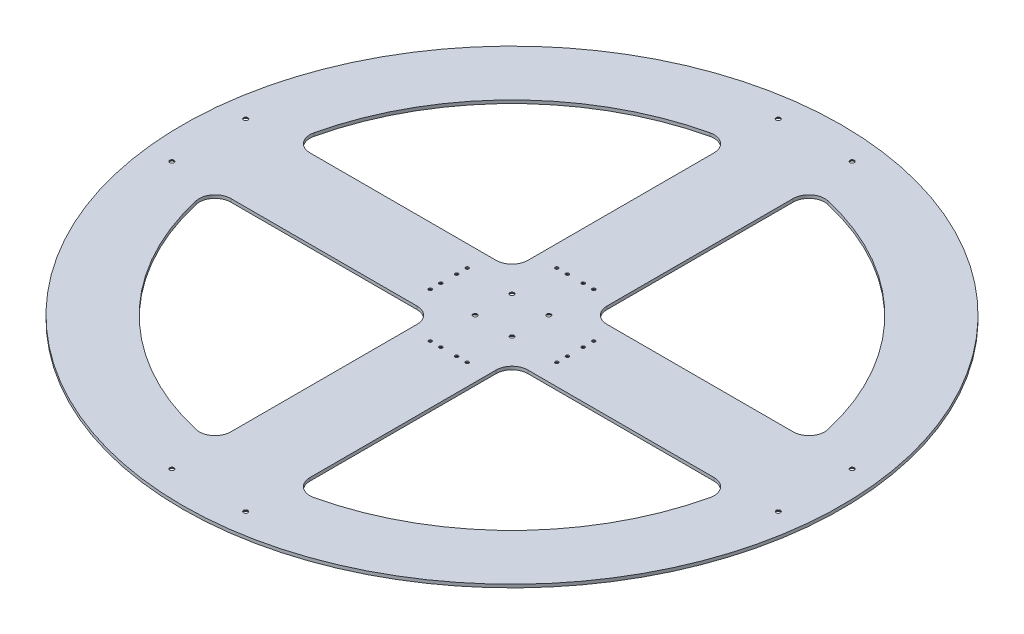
ISO-10303-21;
HEADER;
FILE_DESCRIPTION(('STEP AP214'),'2;1');
FILE_NAME('part.step','',(''),(''),'','','');
FILE_SCHEMA(('AUTOMOTIVE_DESIGN { 1 0 10303 214 1 1 1 1 }'));
ENDSEC;
DATA;
#1=APPLICATION_CONTEXT('core data for automotive mechanical design processes');
#2=APPLICATION_PROTOCOL_DEFINITION('international standard','automotive_design',2000,#1);
#3=PRODUCT_CONTEXT('',#1,'mechanical');
#4=PRODUCT('Part','Part','',(#3));
#5=PRODUCT_RELATED_PRODUCT_CATEGORY('part','',(#4));
#6=PRODUCT_DEFINITION_FORMATION('','',#4);
#7=PRODUCT_DEFINITION_CONTEXT('part definition',#1,'design');
#8=PRODUCT_DEFINITION('design','',#6,#7);
#9=PRODUCT_DEFINITION_SHAPE('','',#8);
#10=(LENGTH_UNIT() NAMED_UNIT(*) SI_UNIT(.MILLI.,.METRE.));
#11=(NAMED_UNIT(*) PLANE_ANGLE_UNIT() SI_UNIT($,.RADIAN.));
#12=(NAMED_UNIT(*) SI_UNIT($,.STERADIAN.) SOLID_ANGLE_UNIT());
#13=UNCERTAINTY_MEASURE_WITH_UNIT(LENGTH_MEASURE(1.E-05),#10,'distance_accuracy_value','');
#14=(GEOMETRIC_REPRESENTATION_CONTEXT(3) GLOBAL_UNCERTAINTY_ASSIGNED_CONTEXT((#13)) GLOBAL_UNIT_ASSIGNED_CONTEXT((#10,
#11,#12)) REPRESENTATION_CONTEXT('',''));
#15=CARTESIAN_POINT('',(0.,0.,0.));
#16=DIRECTION('',(0.,0.,1.));
#17=DIRECTION('',(1.,0.,0.));
#18=AXIS2_PLACEMENT_3D('',#15,#16,#17);
#19=CARTESIAN_POINT('',(0.,6.,0.));
#20=DIRECTION('',(0.,1.,0.));
#21=DIRECTION('',(0.,0.,1.));
#22=AXIS2_PLACEMENT_3D('',#19,#20,#21);
#23=PLANE('',#22);
#24=CARTESIAN_POINT('',(14.9999999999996,6.,120.));
#25=DIRECTION('',(0.,1.,0.));
#26=DIRECTION('',(-1.,0.,0.));
#27=AXIS2_PLACEMENT_3D('',#24,#25,#26);
#28=CIRCLE('',#27,3.04999999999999);
#29=CARTESIAN_POINT('',(11.9499999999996,6.,120.));
#30=VERTEX_POINT('',#29);
#31=EDGE_CURVE('E1304',#30,#30,#28,.T.);
#32=ORIENTED_EDGE('',*,*,#31,.F.);
#33=EDGE_LOOP('',(#32));
#34=FACE_BOUND('',#33,.T.);
#35=CARTESIAN_POINT('',(-15.0000000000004,6.,120.));
#36=DIRECTION('',(0.,1.,0.));
#37=DIRECTION('',(-1.,0.,0.));
#38=AXIS2_PLACEMENT_3D('',#35,#36,#37);
#39=CIRCLE('',#38,3.04999999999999);
#40=CARTESIAN_POINT('',(-18.0500000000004,6.,120.));
#41=VERTEX_POINT('',#40);
#42=EDGE_CURVE('E1615',#41,#41,#39,.T.);
#43=ORIENTED_EDGE('',*,*,#42,.F.);
#44=EDGE_LOOP('',(#43));
#45=FACE_BOUND('',#44,.T.);
#46=CARTESIAN_POINT('',(-35.0000000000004,6.,120.));
#47=DIRECTION('',(0.,1.,0.));
#48=DIRECTION('',(-1.,0.,0.));
#49=AXIS2_PLACEMENT_3D('',#46,#47,#48);
#50=CIRCLE('',#49,3.04999999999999);
#51=CARTESIAN_POINT('',(-38.0500000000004,6.,120.));
#52=VERTEX_POINT('',#51);
#53=EDGE_CURVE('E1619',#52,#52,#50,.T.);
#54=ORIENTED_EDGE('',*,*,#53,.F.);
#55=EDGE_LOOP('',(#54));
#56=FACE_BOUND('',#55,.T.);
#57=CARTESIAN_POINT('',(-120.,6.,35.));
#58=DIRECTION('',(0.,1.,0.));
#59=DIRECTION('',(0.,0.,-1.));
#60=AXIS2_PLACEMENT_3D('',#57,#58,#59);
#61=CIRCLE('',#60,3.04999999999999);
#62=CARTESIAN_POINT('',(-120.,6.,31.95));
#63=VERTEX_POINT('',#62);
#64=EDGE_CURVE('E1624',#63,#63,#61,.T.);
#65=ORIENTED_EDGE('',*,*,#64,.F.);
#66=EDGE_LOOP('',(#65));
#67=FACE_BOUND('',#66,.T.);
#68=CARTESIAN_POINT('',(-120.,6.,15.));
#69=DIRECTION('',(0.,1.,0.));
#70=DIRECTION('',(0.,0.,-1.));
#71=AXIS2_PLACEMENT_3D('',#68,#69,#70);
#72=CIRCLE('',#71,3.04999999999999);
#73=CARTESIAN_POINT('',(-120.,6.,11.95));
#74=VERTEX_POINT('',#73);
#75=EDGE_CURVE('E1627',#74,#74,#72,.T.);
#76=ORIENTED_EDGE('',*,*,#75,.F.);
#77=EDGE_LOOP('',(#76));
#78=FACE_BOUND('',#77,.T.);
#79=CARTESIAN_POINT('',(-120.,6.,-15.));
#80=DIRECTION('',(0.,1.,0.));
#81=DIRECTION('',(0.,0.,-1.));
#82=AXIS2_PLACEMENT_3D('',#79,#80,#81);
#83=CIRCLE('',#82,3.04999999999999);
#84=CARTESIAN_POINT('',(-120.,6.,-18.05));
#85=VERTEX_POINT('',#84);
#86=EDGE_CURVE('E1288',#85,#85,#83,.T.);
#87=ORIENTED_EDGE('',*,*,#86,.F.);
#88=EDGE_LOOP('',(#87));
#89=FACE_BOUND('',#88,.T.);
#90=CARTESIAN_POINT('',(-120.,6.,-35.));
#91=DIRECTION('',(0.,1.,0.));
#92=DIRECTION('',(0.,0.,-1.));
#93=AXIS2_PLACEMENT_3D('',#90,#91,#92);
#94=CIRCLE('',#93,3.04999999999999);
#95=CARTESIAN_POINT('',(-120.,6.,-38.05));
#96=VERTEX_POINT('',#95);
#97=EDGE_CURVE('E1284',#96,#96,#94,.T.);
#98=ORIENTED_EDGE('',*,*,#97,.F.);
#99=EDGE_LOOP('',(#98));
#100=FACE_BOUND('',#99,.T.);
#101=CARTESIAN_POINT('',(-34.9999999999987,6.,-120.));
#102=DIRECTION('',(0.,1.,0.));
#103=DIRECTION('',(1.,0.,0.));
#104=AXIS2_PLACEMENT_3D('',#101,#102,#103);
#105=CIRCLE('',#104,3.04999999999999);
#106=CARTESIAN_POINT('',(-31.9499999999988,6.,-120.));
#107=VERTEX_POINT('',#106);
#108=EDGE_CURVE('E1282',#107,#107,#105,.T.);
#109=ORIENTED_EDGE('',*,*,#108,.F.);
#110=EDGE_LOOP('',(#109));
#111=FACE_BOUND('',#110,.T.);
#112=CARTESIAN_POINT('',(-14.9999999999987,6.,-120.));
#113=DIRECTION('',(0.,1.,0.));
#114=DIRECTION('',(1.,0.,0.));
#115=AXIS2_PLACEMENT_3D('',#112,#113,#114);
#116=CIRCLE('',#115,3.04999999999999);
#117=CARTESIAN_POINT('',(-11.9499999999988,6.,-120.));
#118=VERTEX_POINT('',#117);
#119=EDGE_CURVE('E1285',#118,#118,#116,.T.);
#120=ORIENTED_EDGE('',*,*,#119,.F.);
#121=EDGE_LOOP('',(#120));
#122=FACE_BOUND('',#121,.T.);
#123=CARTESIAN_POINT('',(15.0000000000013,6.,-120.));
#124=DIRECTION('',(0.,1.,0.));
#125=DIRECTION('',(1.,0.,0.));
#126=AXIS2_PLACEMENT_3D('',#123,#124,#125);
#127=CIRCLE('',#126,3.04999999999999);
#128=CARTESIAN_POINT('',(18.0500000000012,6.,-120.));
#129=VERTEX_POINT('',#128);
#130=EDGE_CURVE('E1291',#129,#129,#127,.T.);
#131=ORIENTED_EDGE('',*,*,#130,.F.);
#132=EDGE_LOOP('',(#131));
#133=FACE_BOUND('',#132,.T.);
#134=CARTESIAN_POINT('',(35.0000000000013,6.,-120.));
#135=DIRECTION('',(0.,1.,0.));
#136=DIRECTION('',(1.,0.,0.));
#137=AXIS2_PLACEMENT_3D('',#134,#135,#136);
#138=CIRCLE('',#137,3.04999999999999);
#139=CARTESIAN_POINT('',(38.0500000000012,6.,-120.));
#140=VERTEX_POINT('',#139);
#141=EDGE_CURVE('E1297',#140,#140,#138,.T.);
#142=ORIENTED_EDGE('',*,*,#141,.F.);
#143=EDGE_LOOP('',(#142));
#144=FACE_BOUND('',#143,.T.);
#145=CARTESIAN_POINT('',(34.9999999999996,6.,120.));
#146=DIRECTION('',(0.,1.,0.));
#147=DIRECTION('',(-1.,0.,0.));
#148=AXIS2_PLACEMENT_3D('',#145,#146,#147);
#149=CIRCLE('',#148,3.04999999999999);
#150=CARTESIAN_POINT('',(31.9499999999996,6.,120.));
#151=VERTEX_POINT('',#150);
#152=EDGE_CURVE('E1300',#151,#151,#149,.T.);
#153=ORIENTED_EDGE('',*,*,#152,.F.);
#154=EDGE_LOOP('',(#153));
#155=FACE_BOUND('',#154,.T.);
#156=CARTESIAN_POINT('',(120.,6.,-15.));
#157=DIRECTION('',(0.,1.,0.));
#158=DIRECTION('',(0.,0.,1.));
#159=AXIS2_PLACEMENT_3D('',#156,#157,#158);
#160=CIRCLE('',#159,3.04999999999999);
#161=CARTESIAN_POINT('',(120.,6.,-11.95));
#162=VERTEX_POINT('',#161);
#163=EDGE_CURVE('E1305',#162,#162,#160,.T.);
#164=ORIENTED_EDGE('',*,*,#163,.F.);
#165=EDGE_LOOP('',(#164));
#166=FACE_BOUND('',#165,.T.);
#167=CARTESIAN_POINT('',(120.,6.,15.));
#168=DIRECTION('',(0.,1.,0.));
#169=DIRECTION('',(0.,0.,1.));
#170=AXIS2_PLACEMENT_3D('',#167,#168,#169);
#171=CIRCLE('',#170,3.04999999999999);
#172=CARTESIAN_POINT('',(120.,6.,18.05));
#173=VERTEX_POINT('',#172);
#174=EDGE_CURVE('E1309',#173,#173,#171,.T.);
#175=ORIENTED_EDGE('',*,*,#174,.F.);
#176=EDGE_LOOP('',(#175));
#177=FACE_BOUND('',#176,.T.);
#178=CARTESIAN_POINT('',(120.,6.,35.));
#179=DIRECTION('',(0.,1.,0.));
#180=DIRECTION('',(0.,0.,1.));
#181=AXIS2_PLACEMENT_3D('',#178,#179,#180);
#182=CIRCLE('',#181,3.04999999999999);
#183=CARTESIAN_POINT('',(120.,6.,38.05));
#184=VERTEX_POINT('',#183);
#185=EDGE_CURVE('E1303',#184,#184,#182,.T.);
#186=ORIENTED_EDGE('',*,*,#185,.F.);
#187=EDGE_LOOP('',(#186));
#188=FACE_BOUND('',#187,.T.);
#189=CARTESIAN_POINT('',(120.,6.,-35.));
#190=DIRECTION('',(0.,1.,0.));
#191=DIRECTION('',(0.,0.,1.));
#192=AXIS2_PLACEMENT_3D('',#189,#190,#191);
#193=CIRCLE('',#192,3.04999999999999);
#194=CARTESIAN_POINT('',(120.,6.,-31.95));
#195=VERTEX_POINT('',#194);
#196=EDGE_CURVE('E1308',#195,#195,#193,.T.);
#197=ORIENTED_EDGE('',*,*,#196,.F.);
#198=EDGE_LOOP('',(#197));
#199=FACE_BOUND('',#198,.T.);
#200=CARTESIAN_POINT('',(-575.000000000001,6.,69.999999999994));
#201=DIRECTION('',(0.,1.,0.));
#202=DIRECTION('',(1.,0.,0.));
#203=AXIS2_PLACEMENT_3D('',#200,#201,#202);
#204=CIRCLE('',#203,4.10000000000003);
#205=CARTESIAN_POINT('',(-570.900000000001,6.,69.999999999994));
#206=VERTEX_POINT('',#205);
#207=EDGE_CURVE('E1316',#206,#206,#204,.T.);
#208=ORIENTED_EDGE('',*,*,#207,.F.);
#209=EDGE_LOOP('',(#208));
#210=FACE_BOUND('',#209,.T.);
#211=CARTESIAN_POINT('',(-574.999999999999,6.,-70.000000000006));
#212=DIRECTION('',(0.,1.,0.));
#213=DIRECTION('',(1.,0.,0.));
#214=AXIS2_PLACEMENT_3D('',#211,#212,#213);
#215=CIRCLE('',#214,4.10000000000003);
#216=CARTESIAN_POINT('',(-570.899999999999,6.,-70.000000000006));
#217=VERTEX_POINT('',#216);
#218=EDGE_CURVE('E1321',#217,#217,#215,.T.);
#219=ORIENTED_EDGE('',*,*,#218,.F.);
#220=EDGE_LOOP('',(#219));
#221=FACE_BOUND('',#220,.T.);
#222=CARTESIAN_POINT('',(70.,6.,575.));
#223=DIRECTION('',(0.,1.,0.));
#224=DIRECTION('',(0.,0.,-1.));
#225=AXIS2_PLACEMENT_3D('',#222,#223,#224);
#226=CIRCLE('',#225,4.10000000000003);
#227=CARTESIAN_POINT('',(70.,6.,570.9));
#228=VERTEX_POINT('',#227);
#229=EDGE_CURVE('E1317',#228,#228,#226,.T.);
#230=ORIENTED_EDGE('',*,*,#229,.F.);
#231=EDGE_LOOP('',(#230));
#232=FACE_BOUND('',#231,.T.);
#233=CARTESIAN_POINT('',(-70.,6.,575.));
#234=DIRECTION('',(0.,1.,0.));
#235=DIRECTION('',(0.,0.,-1.));
#236=AXIS2_PLACEMENT_3D('',#233,#234,#235);
#237=CIRCLE('',#236,4.10000000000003);
#238=CARTESIAN_POINT('',(-70.,6.,570.9));
#239=VERTEX_POINT('',#238);
#240=EDGE_CURVE('E1320',#239,#239,#237,.T.);
#241=ORIENTED_EDGE('',*,*,#240,.F.);
#242=EDGE_LOOP('',(#241));
#243=FACE_BOUND('',#242,.T.);
#244=CARTESIAN_POINT('',(575.,6.,-69.999999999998));
#245=DIRECTION('',(0.,1.,0.));
#246=DIRECTION('',(-1.,0.,0.));
#247=AXIS2_PLACEMENT_3D('',#244,#245,#246);
#248=CIRCLE('',#247,4.10000000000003);
#249=CARTESIAN_POINT('',(570.9,6.,-69.999999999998));
#250=VERTEX_POINT('',#249);
#251=EDGE_CURVE('E1326',#250,#250,#248,.T.);
#252=ORIENTED_EDGE('',*,*,#251,.F.);
#253=EDGE_LOOP('',(#252));
#254=FACE_BOUND('',#253,.T.);
#255=CARTESIAN_POINT('',(575.,6.,70.000000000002));
#256=DIRECTION('',(0.,1.,0.));
#257=DIRECTION('',(-1.,0.,0.));
#258=AXIS2_PLACEMENT_3D('',#255,#256,#257);
#259=CIRCLE('',#258,4.10000000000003);
#260=CARTESIAN_POINT('',(570.9,6.,70.000000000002));
#261=VERTEX_POINT('',#260);
#262=EDGE_CURVE('E1329',#261,#261,#259,.T.);
#263=ORIENTED_EDGE('',*,*,#262,.F.);
#264=EDGE_LOOP('',(#263));
#265=FACE_BOUND('',#264,.T.);
#266=CARTESIAN_POINT('',(-70.,6.,-575.));
#267=DIRECTION('',(0.,1.,0.));
#268=DIRECTION('',(0.,0.,1.));
#269=AXIS2_PLACEMENT_3D('',#266,#267,#268);
#270=CIRCLE('',#269,4.10000000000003);
#271=CARTESIAN_POINT('',(-70.,6.,-570.9));
#272=VERTEX_POINT('',#271);
#273=EDGE_CURVE('E1334',#272,#272,#270,.T.);
#274=ORIENTED_EDGE('',*,*,#273,.F.);
#275=EDGE_LOOP('',(#274));
#276=FACE_BOUND('',#275,.T.);
#277=CARTESIAN_POINT('',(70.,6.,-575.));
#278=DIRECTION('',(0.,1.,0.));
#279=DIRECTION('',(0.,0.,1.));
#280=AXIS2_PLACEMENT_3D('',#277,#278,#279);
#281=CIRCLE('',#280,4.10000000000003);
#282=CARTESIAN_POINT('',(70.,6.,-570.9));
#283=VERTEX_POINT('',#282);
#284=EDGE_CURVE('E1337',#283,#283,#281,.T.);
#285=ORIENTED_EDGE('',*,*,#284,.F.);
#286=EDGE_LOOP('',(#285));
#287=FACE_BOUND('',#286,.T.);
#288=CARTESIAN_POINT('',(-35.,6.,35.));
#289=DIRECTION('',(0.,1.,0.));
#290=DIRECTION('',(0.,0.,1.));
#291=AXIS2_PLACEMENT_3D('',#288,#289,#290);
#292=CIRCLE('',#291,4.);
#293=CARTESIAN_POINT('',(-35.,6.,39.));
#294=VERTEX_POINT('',#293);
#295=EDGE_CURVE('E1341',#294,#294,#292,.T.);
#296=ORIENTED_EDGE('',*,*,#295,.F.);
#297=EDGE_LOOP('',(#296));
#298=FACE_BOUND('',#297,.T.);
#299=CARTESIAN_POINT('',(35.,6.,35.));
#300=DIRECTION('',(0.,1.,0.));
#301=DIRECTION('',(0.,0.,1.));
#302=AXIS2_PLACEMENT_3D('',#299,#300,#301);
#303=CIRCLE('',#302,4.00000000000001);
#304=CARTESIAN_POINT('',(35.,6.,39.));
#305=VERTEX_POINT('',#304);
#306=EDGE_CURVE('E1345',#305,#305,#303,.T.);
#307=ORIENTED_EDGE('',*,*,#306,.F.);
#308=EDGE_LOOP('',(#307));
#309=FACE_BOUND('',#308,.T.);
#310=CARTESIAN_POINT('',(35.,6.,-35.));
#311=DIRECTION('',(0.,1.,0.));
#312=DIRECTION('',(0.,0.,1.));
#313=AXIS2_PLACEMENT_3D('',#310,#311,#312);
#314=CIRCLE('',#313,4.00000000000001);
#315=CARTESIAN_POINT('',(35.,6.,-31.));
#316=VERTEX_POINT('',#315);
#317=EDGE_CURVE('E1340',#316,#316,#314,.T.);
#318=ORIENTED_EDGE('',*,*,#317,.F.);
#319=EDGE_LOOP('',(#318));
#320=FACE_BOUND('',#319,.T.);
#321=CARTESIAN_POINT('',(-35.,6.,-35.));
#322=DIRECTION('',(0.,1.,0.));
#323=DIRECTION('',(0.,0.,1.));
#324=AXIS2_PLACEMENT_3D('',#321,#322,#323);
#325=CIRCLE('',#324,4.);
#326=CARTESIAN_POINT('',(-35.,6.,-31.));
#327=VERTEX_POINT('',#326);
#328=EDGE_CURVE('E1344',#327,#327,#325,.T.);
#329=ORIENTED_EDGE('',*,*,#328,.F.);
#330=EDGE_LOOP('',(#329));
#331=FACE_BOUND('',#330,.T.);
#332=CARTESIAN_POINT('',(0.,6.,0.));
#333=DIRECTION('',(0.,1.,0.));
#334=DIRECTION('',(0.,0.,1.));
#335=AXIS2_PLACEMENT_3D('',#332,#333,#334);
#336=CIRCLE('',#335,625.);
#337=CARTESIAN_POINT('',(0.,6.,625.));
#338=VERTEX_POINT('',#337);
#339=EDGE_CURVE('E223',#338,#338,#336,.T.);
#340=ORIENTED_EDGE('',*,*,#339,.T.);
#341=EDGE_LOOP('',(#340));
#342=FACE_BOUND('',#341,.T.);
#343=DIRECTION('',(0.,0.,-1.));
#344=VECTOR('',#343,1.);
#345=CARTESIAN_POINT('',(-75.,6.,75.0000000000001));
#346=LINE('',#345,#344);
#347=CARTESIAN_POINT('',(-74.9999999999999,6.,458.121163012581));
#348=VERTEX_POINT('',#347);
#349=CARTESIAN_POINT('',(-75.,6.,105.));
#350=VERTEX_POINT('',#349);
#351=EDGE_CURVE('E587',#348,#350,#346,.T.);
#352=ORIENTED_EDGE('',*,*,#351,.F.);
#353=CARTESIAN_POINT('',(-105.,6.,458.121163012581));
#354=DIRECTION('',(0.,1.,0.));
#355=DIRECTION('',(0.,0.,1.));
#356=AXIS2_PLACEMENT_3D('',#353,#354,#355);
#357=CIRCLE('',#356,30.);
#358=CARTESIAN_POINT('',(-111.702127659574,6.,487.362939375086));
#359=VERTEX_POINT('',#358);
#360=EDGE_CURVE('E306',#348,#359,#357,.F.);
#361=ORIENTED_EDGE('',*,*,#360,.T.);
#362=CARTESIAN_POINT('',(0.,6.,0.));
#363=DIRECTION('',(0.,1.,0.));
#364=DIRECTION('',(0.,0.,1.));
#365=AXIS2_PLACEMENT_3D('',#362,#363,#364);
#366=CIRCLE('',#365,500.);
#367=CARTESIAN_POINT('',(-487.362939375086,6.,111.702127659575));
#368=VERTEX_POINT('',#367);
#369=EDGE_CURVE('E584',#368,#359,#366,.T.);
#370=ORIENTED_EDGE('',*,*,#369,.F.);
#371=CARTESIAN_POINT('',(-458.121163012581,6.,105.));
#372=DIRECTION('',(0.,1.,0.));
#373=DIRECTION('',(0.,0.,1.));
#374=AXIS2_PLACEMENT_3D('',#371,#372,#373);
#375=CIRCLE('',#374,30.);
#376=CARTESIAN_POINT('',(-458.121163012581,6.,75.0000000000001));
#377=VERTEX_POINT('',#376);
#378=EDGE_CURVE('E310',#368,#377,#375,.F.);
#379=ORIENTED_EDGE('',*,*,#378,.T.);
#380=DIRECTION('',(-1.,0.,0.));
#381=VECTOR('',#380,1.);
#382=CARTESIAN_POINT('',(-75.,6.,75.0000000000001));
#383=LINE('',#382,#381);
#384=CARTESIAN_POINT('',(-105.,6.,75.0000000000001));
#385=VERTEX_POINT('',#384);
#386=EDGE_CURVE('E590',#385,#377,#383,.T.);
#387=ORIENTED_EDGE('',*,*,#386,.F.);
#388=CARTESIAN_POINT('',(-105.,6.,105.));
#389=DIRECTION('',(0.,1.,0.));
#390=DIRECTION('',(0.,0.,1.));
#391=AXIS2_PLACEMENT_3D('',#388,#389,#390);
#392=CIRCLE('',#391,30.);
#393=EDGE_CURVE('E314',#385,#350,#392,.F.);
#394=ORIENTED_EDGE('',*,*,#393,.T.);
#395=EDGE_LOOP('',(#352,#361,#370,#379,#387,#394));
#396=FACE_BOUND('',#395,.T.);
#397=DIRECTION('',(0.,0.,-1.));
#398=VECTOR('',#397,1.);
#399=CARTESIAN_POINT('',(-74.9999999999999,6.,-494.34299833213));
#400=LINE('',#399,#398);
#401=CARTESIAN_POINT('',(-75.,6.,-105.));
#402=VERTEX_POINT('',#401);
#403=CARTESIAN_POINT('',(-74.9999999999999,6.,-458.121163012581));
#404=VERTEX_POINT('',#403);
#405=EDGE_CURVE('E578',#402,#404,#400,.T.);
#406=ORIENTED_EDGE('',*,*,#405,.F.);
#407=CARTESIAN_POINT('',(-105.,6.,-105.));
#408=DIRECTION('',(0.,1.,0.));
#409=DIRECTION('',(0.,0.,1.));
#410=AXIS2_PLACEMENT_3D('',#407,#408,#409);
#411=CIRCLE('',#410,30.);
#412=CARTESIAN_POINT('',(-105.,6.,-75.));
#413=VERTEX_POINT('',#412);
#414=EDGE_CURVE('E322',#402,#413,#411,.F.);
#415=ORIENTED_EDGE('',*,*,#414,.T.);
#416=DIRECTION('',(1.,0.,0.));
#417=VECTOR('',#416,1.);
#418=CARTESIAN_POINT('',(-75.,6.,-75.));
#419=LINE('',#418,#417);
#420=CARTESIAN_POINT('',(-458.121163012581,6.,-74.9999999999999));
#421=VERTEX_POINT('',#420);
#422=EDGE_CURVE('E574',#421,#413,#419,.T.);
#423=ORIENTED_EDGE('',*,*,#422,.F.);
#424=CARTESIAN_POINT('',(-458.121163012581,6.,-105.));
#425=DIRECTION('',(0.,1.,0.));
#426=DIRECTION('',(0.,0.,1.));
#427=AXIS2_PLACEMENT_3D('',#424,#425,#426);
#428=CIRCLE('',#427,30.);
#429=CARTESIAN_POINT('',(-487.362939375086,6.,-111.702127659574));
#430=VERTEX_POINT('',#429);
#431=EDGE_CURVE('E318',#421,#430,#428,.F.);
#432=ORIENTED_EDGE('',*,*,#431,.T.);
#433=CARTESIAN_POINT('',(0.,6.,0.));
#434=DIRECTION('',(0.,1.,0.));
#435=DIRECTION('',(0.,0.,1.));
#436=AXIS2_PLACEMENT_3D('',#433,#434,#435);
#437=CIRCLE('',#436,500.);
#438=CARTESIAN_POINT('',(-111.702127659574,6.,-487.362939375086));
#439=VERTEX_POINT('',#438);
#440=EDGE_CURVE('E597',#439,#430,#437,.T.);
#441=ORIENTED_EDGE('',*,*,#440,.F.);
#442=CARTESIAN_POINT('',(-105.,6.,-458.121163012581));
#443=DIRECTION('',(0.,1.,0.));
#444=DIRECTION('',(0.,0.,1.));
#445=AXIS2_PLACEMENT_3D('',#442,#443,#444);
#446=CIRCLE('',#445,30.);
#447=EDGE_CURVE('E50',#439,#404,#446,.F.);
#448=ORIENTED_EDGE('',*,*,#447,.T.);
#449=EDGE_LOOP('',(#406,#415,#423,#432,#441,#448));
#450=FACE_BOUND('',#449,.T.);
#451=CARTESIAN_POINT('',(0.,6.,0.));
#452=DIRECTION('',(0.,1.,0.));
#453=DIRECTION('',(0.,0.,1.));
#454=AXIS2_PLACEMENT_3D('',#451,#452,#453);
#455=CIRCLE('',#454,500.);
#456=CARTESIAN_POINT('',(111.702127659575,6.,487.362939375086));
#457=VERTEX_POINT('',#456);
#458=CARTESIAN_POINT('',(487.362939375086,6.,111.702127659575));
#459=VERTEX_POINT('',#458);
#460=EDGE_CURVE('E1367',#457,#459,#455,.T.);
#461=ORIENTED_EDGE('',*,*,#460,.F.);
#462=CARTESIAN_POINT('',(105.,6.,458.121163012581));
#463=DIRECTION('',(0.,1.,0.));
#464=DIRECTION('',(0.,0.,1.));
#465=AXIS2_PLACEMENT_3D('',#462,#463,#464);
#466=CIRCLE('',#465,30.);
#467=CARTESIAN_POINT('',(75.0000000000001,6.,458.121163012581));
#468=VERTEX_POINT('',#467);
#469=EDGE_CURVE('E302',#457,#468,#466,.F.);
#470=ORIENTED_EDGE('',*,*,#469,.T.);
#471=DIRECTION('',(0.,0.,1.));
#472=VECTOR('',#471,1.);
#473=CARTESIAN_POINT('',(75.0000000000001,6.,75.0000000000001));
#474=LINE('',#473,#472);
#475=CARTESIAN_POINT('',(75.0000000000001,6.,105.));
#476=VERTEX_POINT('',#475);
#477=EDGE_CURVE('E1364',#476,#468,#474,.T.);
#478=ORIENTED_EDGE('',*,*,#477,.F.);
#479=CARTESIAN_POINT('',(105.,6.,105.));
#480=DIRECTION('',(0.,1.,0.));
#481=DIRECTION('',(0.,0.,1.));
#482=AXIS2_PLACEMENT_3D('',#479,#480,#481);
#483=CIRCLE('',#482,30.);
#484=CARTESIAN_POINT('',(105.,6.,75.0000000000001));
#485=VERTEX_POINT('',#484);
#486=EDGE_CURVE('E298',#476,#485,#483,.F.);
#487=ORIENTED_EDGE('',*,*,#486,.T.);
#488=DIRECTION('',(-1.,0.,0.));
#489=VECTOR('',#488,1.);
#490=CARTESIAN_POINT('',(494.34299833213,6.,75.0000000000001));
#491=LINE('',#490,#489);
#492=CARTESIAN_POINT('',(458.121163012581,6.,75.0000000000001));
#493=VERTEX_POINT('',#492);
#494=EDGE_CURVE('E1370',#493,#485,#491,.T.);
#495=ORIENTED_EDGE('',*,*,#494,.F.);
#496=CARTESIAN_POINT('',(458.121163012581,6.,105.));
#497=DIRECTION('',(0.,1.,0.));
#498=DIRECTION('',(0.,0.,1.));
#499=AXIS2_PLACEMENT_3D('',#496,#497,#498);
#500=CIRCLE('',#499,30.);
#501=EDGE_CURVE('E294',#493,#459,#500,.F.);
#502=ORIENTED_EDGE('',*,*,#501,.T.);
#503=EDGE_LOOP('',(#461,#470,#478,#487,#495,#502));
#504=FACE_BOUND('',#503,.T.);
#505=DIRECTION('',(1.,0.,0.));
#506=VECTOR('',#505,1.);
#507=CARTESIAN_POINT('',(494.34299833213,6.,-74.9999999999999));
#508=LINE('',#507,#506);
#509=CARTESIAN_POINT('',(105.,6.,-75.));
#510=VERTEX_POINT('',#509);
#511=CARTESIAN_POINT('',(458.121163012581,6.,-74.9999999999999));
#512=VERTEX_POINT('',#511);
#513=EDGE_CURVE('E1355',#510,#512,#508,.T.);
#514=ORIENTED_EDGE('',*,*,#513,.F.);
#515=CARTESIAN_POINT('',(105.,6.,-105.));
#516=DIRECTION('',(0.,1.,0.));
#517=DIRECTION('',(0.,0.,1.));
#518=AXIS2_PLACEMENT_3D('',#515,#516,#517);
#519=CIRCLE('',#518,30.);
#520=CARTESIAN_POINT('',(75.0000000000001,6.,-105.));
#521=VERTEX_POINT('',#520);
#522=EDGE_CURVE('E290',#510,#521,#519,.F.);
#523=ORIENTED_EDGE('',*,*,#522,.T.);
#524=DIRECTION('',(0.,0.,1.));
#525=VECTOR('',#524,1.);
#526=CARTESIAN_POINT('',(75.0000000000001,6.,-494.34299833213));
#527=LINE('',#526,#525);
#528=CARTESIAN_POINT('',(75.0000000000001,6.,-458.121163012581));
#529=VERTEX_POINT('',#528);
#530=EDGE_CURVE('E219',#529,#521,#527,.T.);
#531=ORIENTED_EDGE('',*,*,#530,.F.);
#532=CARTESIAN_POINT('',(105.,6.,-458.121163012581));
#533=DIRECTION('',(0.,1.,0.));
#534=DIRECTION('',(0.,0.,1.));
#535=AXIS2_PLACEMENT_3D('',#532,#533,#534);
#536=CIRCLE('',#535,30.);
#537=CARTESIAN_POINT('',(111.702127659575,6.,-487.362939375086));
#538=VERTEX_POINT('',#537);
#539=EDGE_CURVE('E209',#529,#538,#536,.F.);
#540=ORIENTED_EDGE('',*,*,#539,.T.);
#541=CARTESIAN_POINT('',(0.,6.,0.));
#542=DIRECTION('',(0.,1.,0.));
#543=DIRECTION('',(0.,0.,1.));
#544=AXIS2_PLACEMENT_3D('',#541,#542,#543);
#545=CIRCLE('',#544,500.);
#546=CARTESIAN_POINT('',(487.362939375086,6.,-111.702127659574));
#547=VERTEX_POINT('',#546);
#548=EDGE_CURVE('E1358',#547,#538,#545,.T.);
#549=ORIENTED_EDGE('',*,*,#548,.F.);
#550=CARTESIAN_POINT('',(458.121163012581,6.,-105.));
#551=DIRECTION('',(0.,1.,0.));
#552=DIRECTION('',(0.,0.,1.));
#553=AXIS2_PLACEMENT_3D('',#550,#551,#552);
#554=CIRCLE('',#553,30.);
#555=EDGE_CURVE('E208',#547,#512,#554,.F.);
#556=ORIENTED_EDGE('',*,*,#555,.T.);
#557=EDGE_LOOP('',(#514,#523,#531,#540,#549,#556));
#558=FACE_BOUND('',#557,.T.);
#559=ADVANCED_FACE('F35',(#34,#45,#56,#67,#78,#89,#100,#111,#122,#133,#144,#155,#166,#177,#188,
#199,#210,#221,#232,#243,#254,#265,#276,#287,#298,#309,#320,#331,#342,#396,#450,#504,#558),#23,.T.);
#560=CARTESIAN_POINT('',(0.,0.,0.));
#561=DIRECTION('',(0.,1.,0.));
#562=DIRECTION('',(0.,0.,1.));
#563=AXIS2_PLACEMENT_3D('',#560,#561,#562);
#564=PLANE('',#563);
#565=CARTESIAN_POINT('',(35.0000000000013,0.,-120.));
#566=DIRECTION('',(0.,1.,0.));
#567=DIRECTION('',(0.,0.,1.));
#568=AXIS2_PLACEMENT_3D('',#565,#566,#567);
#569=CIRCLE('',#568,7.05);
#570=CARTESIAN_POINT('',(35.0000000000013,0.,-112.95));
#571=VERTEX_POINT('',#570);
#572=EDGE_CURVE('E480',#571,#571,#569,.T.);
#573=ORIENTED_EDGE('',*,*,#572,.T.);
#574=EDGE_LOOP('',(#573));
#575=FACE_BOUND('',#574,.T.);
#576=CARTESIAN_POINT('',(15.0000000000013,0.,-120.));
#577=DIRECTION('',(0.,1.,0.));
#578=DIRECTION('',(0.,0.,1.));
#579=AXIS2_PLACEMENT_3D('',#576,#577,#578);
#580=CIRCLE('',#579,7.04999999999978);
#581=CARTESIAN_POINT('',(15.0000000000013,0.,-112.95));
#582=VERTEX_POINT('',#581);
#583=EDGE_CURVE('E477',#582,#582,#580,.T.);
#584=ORIENTED_EDGE('',*,*,#583,.T.);
#585=EDGE_LOOP('',(#584));
#586=FACE_BOUND('',#585,.T.);
#587=CARTESIAN_POINT('',(-14.9999999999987,0.,-120.));
#588=DIRECTION('',(0.,1.,0.));
#589=DIRECTION('',(0.,0.,1.));
#590=AXIS2_PLACEMENT_3D('',#587,#588,#589);
#591=CIRCLE('',#590,7.04999999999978);
#592=CARTESIAN_POINT('',(-14.9999999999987,0.,-112.95));
#593=VERTEX_POINT('',#592);
#594=EDGE_CURVE('E474',#593,#593,#591,.T.);
#595=ORIENTED_EDGE('',*,*,#594,.T.);
#596=EDGE_LOOP('',(#595));
#597=FACE_BOUND('',#596,.T.);
#598=CARTESIAN_POINT('',(-34.9999999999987,0.,-120.));
#599=DIRECTION('',(0.,1.,0.));
#600=DIRECTION('',(0.,0.,1.));
#601=AXIS2_PLACEMENT_3D('',#598,#599,#600);
#602=CIRCLE('',#601,7.05);
#603=CARTESIAN_POINT('',(-34.9999999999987,0.,-112.95));
#604=VERTEX_POINT('',#603);
#605=EDGE_CURVE('E471',#604,#604,#602,.T.);
#606=ORIENTED_EDGE('',*,*,#605,.T.);
#607=EDGE_LOOP('',(#606));
#608=FACE_BOUND('',#607,.T.);
#609=CARTESIAN_POINT('',(-120.,0.,-35.));
#610=DIRECTION('',(0.,1.,0.));
#611=DIRECTION('',(0.,0.,1.));
#612=AXIS2_PLACEMENT_3D('',#609,#610,#611);
#613=CIRCLE('',#612,7.05);
#614=CARTESIAN_POINT('',(-120.,0.,-27.95));
#615=VERTEX_POINT('',#614);
#616=EDGE_CURVE('E456',#615,#615,#613,.T.);
#617=ORIENTED_EDGE('',*,*,#616,.T.);
#618=EDGE_LOOP('',(#617));
#619=FACE_BOUND('',#618,.T.);
#620=CARTESIAN_POINT('',(-120.,0.,-15.));
#621=DIRECTION('',(0.,1.,0.));
#622=DIRECTION('',(0.,0.,1.));
#623=AXIS2_PLACEMENT_3D('',#620,#621,#622);
#624=CIRCLE('',#623,7.04999999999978);
#625=CARTESIAN_POINT('',(-120.,0.,-7.95000000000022));
#626=VERTEX_POINT('',#625);
#627=EDGE_CURVE('E453',#626,#626,#624,.T.);
#628=ORIENTED_EDGE('',*,*,#627,.T.);
#629=EDGE_LOOP('',(#628));
#630=FACE_BOUND('',#629,.T.);
#631=CARTESIAN_POINT('',(-120.,0.,15.));
#632=DIRECTION('',(0.,1.,0.));
#633=DIRECTION('',(0.,0.,1.));
#634=AXIS2_PLACEMENT_3D('',#631,#632,#633);
#635=CIRCLE('',#634,7.04999999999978);
#636=CARTESIAN_POINT('',(-120.,0.,22.0499999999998));
#637=VERTEX_POINT('',#636);
#638=EDGE_CURVE('E450',#637,#637,#635,.T.);
#639=ORIENTED_EDGE('',*,*,#638,.T.);
#640=EDGE_LOOP('',(#639));
#641=FACE_BOUND('',#640,.T.);
#642=CARTESIAN_POINT('',(-120.,0.,35.));
#643=DIRECTION('',(0.,1.,0.));
#644=DIRECTION('',(0.,0.,1.));
#645=AXIS2_PLACEMENT_3D('',#642,#643,#644);
#646=CIRCLE('',#645,7.05);
#647=CARTESIAN_POINT('',(-120.,0.,42.05));
#648=VERTEX_POINT('',#647);
#649=EDGE_CURVE('E447',#648,#648,#646,.T.);
#650=ORIENTED_EDGE('',*,*,#649,.T.);
#651=EDGE_LOOP('',(#650));
#652=FACE_BOUND('',#651,.T.);
#653=CARTESIAN_POINT('',(-35.0000000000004,0.,120.));
#654=DIRECTION('',(0.,1.,0.));
#655=DIRECTION('',(0.,0.,1.));
#656=AXIS2_PLACEMENT_3D('',#653,#654,#655);
#657=CIRCLE('',#656,7.05);
#658=CARTESIAN_POINT('',(-35.0000000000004,0.,127.05));
#659=VERTEX_POINT('',#658);
#660=EDGE_CURVE('E432',#659,#659,#657,.T.);
#661=ORIENTED_EDGE('',*,*,#660,.T.);
#662=EDGE_LOOP('',(#661));
#663=FACE_BOUND('',#662,.T.);
#664=CARTESIAN_POINT('',(-15.0000000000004,0.,120.));
#665=DIRECTION('',(0.,1.,0.));
#666=DIRECTION('',(0.,0.,1.));
#667=AXIS2_PLACEMENT_3D('',#664,#665,#666);
#668=CIRCLE('',#667,7.04999999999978);
#669=CARTESIAN_POINT('',(-15.0000000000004,0.,127.05));
#670=VERTEX_POINT('',#669);
#671=EDGE_CURVE('E429',#670,#670,#668,.T.);
#672=ORIENTED_EDGE('',*,*,#671,.T.);
#673=EDGE_LOOP('',(#672));
#674=FACE_BOUND('',#673,.T.);
#675=CARTESIAN_POINT('',(14.9999999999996,0.,120.));
#676=DIRECTION('',(0.,1.,0.));
#677=DIRECTION('',(0.,0.,1.));
#678=AXIS2_PLACEMENT_3D('',#675,#676,#677);
#679=CIRCLE('',#678,7.04999999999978);
#680=CARTESIAN_POINT('',(14.9999999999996,0.,127.05));
#681=VERTEX_POINT('',#680);
#682=EDGE_CURVE('E426',#681,#681,#679,.T.);
#683=ORIENTED_EDGE('',*,*,#682,.T.);
#684=EDGE_LOOP('',(#683));
#685=FACE_BOUND('',#684,.T.);
#686=CARTESIAN_POINT('',(34.9999999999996,0.,120.));
#687=DIRECTION('',(0.,1.,0.));
#688=DIRECTION('',(0.,0.,1.));
#689=AXIS2_PLACEMENT_3D('',#686,#687,#688);
#690=CIRCLE('',#689,7.05000000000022);
#691=CARTESIAN_POINT('',(34.9999999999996,0.,127.05));
#692=VERTEX_POINT('',#691);
#693=EDGE_CURVE('E423',#692,#692,#690,.T.);
#694=ORIENTED_EDGE('',*,*,#693,.T.);
#695=EDGE_LOOP('',(#694));
#696=FACE_BOUND('',#695,.T.);
#697=CARTESIAN_POINT('',(120.,0.,35.));
#698=DIRECTION('',(0.,1.,0.));
#699=DIRECTION('',(0.,0.,1.));
#700=AXIS2_PLACEMENT_3D('',#697,#698,#699);
#701=CIRCLE('',#700,7.05);
#702=CARTESIAN_POINT('',(120.,0.,42.05));
#703=VERTEX_POINT('',#702);
#704=EDGE_CURVE('E408',#703,#703,#701,.T.);
#705=ORIENTED_EDGE('',*,*,#704,.T.);
#706=EDGE_LOOP('',(#705));
#707=FACE_BOUND('',#706,.T.);
#708=CARTESIAN_POINT('',(120.,0.,15.));
#709=DIRECTION('',(0.,1.,0.));
#710=DIRECTION('',(0.,0.,1.));
#711=AXIS2_PLACEMENT_3D('',#708,#709,#710);
#712=CIRCLE('',#711,7.04999999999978);
#713=CARTESIAN_POINT('',(120.,0.,22.0499999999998));
#714=VERTEX_POINT('',#713);
#715=EDGE_CURVE('E405',#714,#714,#712,.T.);
#716=ORIENTED_EDGE('',*,*,#715,.T.);
#717=EDGE_LOOP('',(#716));
#718=FACE_BOUND('',#717,.T.);
#719=CARTESIAN_POINT('',(120.,0.,-15.));
#720=DIRECTION('',(0.,1.,0.));
#721=DIRECTION('',(0.,0.,1.));
#722=AXIS2_PLACEMENT_3D('',#719,#720,#721);
#723=CIRCLE('',#722,7.04999999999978);
#724=CARTESIAN_POINT('',(120.,0.,-7.95000000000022));
#725=VERTEX_POINT('',#724);
#726=EDGE_CURVE('E402',#725,#725,#723,.T.);
#727=ORIENTED_EDGE('',*,*,#726,.T.);
#728=EDGE_LOOP('',(#727));
#729=FACE_BOUND('',#728,.T.);
#730=CARTESIAN_POINT('',(120.,0.,-35.));
#731=DIRECTION('',(0.,1.,0.));
#732=DIRECTION('',(0.,0.,1.));
#733=AXIS2_PLACEMENT_3D('',#730,#731,#732);
#734=CIRCLE('',#733,7.05);
#735=CARTESIAN_POINT('',(120.,0.,-27.95));
#736=VERTEX_POINT('',#735);
#737=EDGE_CURVE('E399',#736,#736,#734,.T.);
#738=ORIENTED_EDGE('',*,*,#737,.T.);
#739=EDGE_LOOP('',(#738));
#740=FACE_BOUND('',#739,.T.);
#741=CARTESIAN_POINT('',(-575.000000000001,0.,69.999999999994));
#742=DIRECTION('',(0.,1.,0.));
#743=DIRECTION('',(0.,0.,1.));
#744=AXIS2_PLACEMENT_3D('',#741,#742,#743);
#745=CIRCLE('',#744,9.09999999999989);
#746=CARTESIAN_POINT('',(-575.000000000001,0.,79.0999999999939));
#747=VERTEX_POINT('',#746);
#748=EDGE_CURVE('E390',#747,#747,#745,.T.);
#749=ORIENTED_EDGE('',*,*,#748,.T.);
#750=EDGE_LOOP('',(#749));
#751=FACE_BOUND('',#750,.T.);
#752=CARTESIAN_POINT('',(-574.999999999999,0.,-70.000000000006));
#753=DIRECTION('',(0.,1.,0.));
#754=DIRECTION('',(0.,0.,1.));
#755=AXIS2_PLACEMENT_3D('',#752,#753,#754);
#756=CIRCLE('',#755,9.09999999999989);
#757=CARTESIAN_POINT('',(-574.999999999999,0.,-60.9000000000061));
#758=VERTEX_POINT('',#757);
#759=EDGE_CURVE('E387',#758,#758,#756,.T.);
#760=ORIENTED_EDGE('',*,*,#759,.T.);
#761=EDGE_LOOP('',(#760));
#762=FACE_BOUND('',#761,.T.);
#763=CARTESIAN_POINT('',(70.,0.,575.));
#764=DIRECTION('',(0.,1.,0.));
#765=DIRECTION('',(0.,0.,1.));
#766=AXIS2_PLACEMENT_3D('',#763,#764,#765);
#767=CIRCLE('',#766,9.09999999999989);
#768=CARTESIAN_POINT('',(70.,0.,584.1));
#769=VERTEX_POINT('',#768);
#770=EDGE_CURVE('E378',#769,#769,#767,.T.);
#771=ORIENTED_EDGE('',*,*,#770,.T.);
#772=EDGE_LOOP('',(#771));
#773=FACE_BOUND('',#772,.T.);
#774=CARTESIAN_POINT('',(-70.,0.,575.));
#775=DIRECTION('',(0.,1.,0.));
#776=DIRECTION('',(0.,0.,1.));
#777=AXIS2_PLACEMENT_3D('',#774,#775,#776);
#778=CIRCLE('',#777,9.09999999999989);
#779=CARTESIAN_POINT('',(-70.,0.,584.1));
#780=VERTEX_POINT('',#779);
#781=EDGE_CURVE('E375',#780,#780,#778,.T.);
#782=ORIENTED_EDGE('',*,*,#781,.T.);
#783=EDGE_LOOP('',(#782));
#784=FACE_BOUND('',#783,.T.);
#785=CARTESIAN_POINT('',(575.,0.,-69.999999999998));
#786=DIRECTION('',(0.,1.,0.));
#787=DIRECTION('',(0.,0.,1.));
#788=AXIS2_PLACEMENT_3D('',#785,#786,#787);
#789=CIRCLE('',#788,9.09999999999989);
#790=CARTESIAN_POINT('',(575.,0.,-60.8999999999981));
#791=VERTEX_POINT('',#790);
#792=EDGE_CURVE('E366',#791,#791,#789,.T.);
#793=ORIENTED_EDGE('',*,*,#792,.T.);
#794=EDGE_LOOP('',(#793));
#795=FACE_BOUND('',#794,.T.);
#796=CARTESIAN_POINT('',(575.,0.,70.000000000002));
#797=DIRECTION('',(0.,1.,0.));
#798=DIRECTION('',(0.,0.,1.));
#799=AXIS2_PLACEMENT_3D('',#796,#797,#798);
#800=CIRCLE('',#799,9.09999999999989);
#801=CARTESIAN_POINT('',(575.,0.,79.1000000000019));
#802=VERTEX_POINT('',#801);
#803=EDGE_CURVE('E363',#802,#802,#800,.T.);
#804=ORIENTED_EDGE('',*,*,#803,.T.);
#805=EDGE_LOOP('',(#804));
#806=FACE_BOUND('',#805,.T.);
#807=CARTESIAN_POINT('',(-70.,0.,-575.));
#808=DIRECTION('',(0.,1.,0.));
#809=DIRECTION('',(0.,0.,1.));
#810=AXIS2_PLACEMENT_3D('',#807,#808,#809);
#811=CIRCLE('',#810,9.09999999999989);
#812=CARTESIAN_POINT('',(-70.,0.,-565.9));
#813=VERTEX_POINT('',#812);
#814=EDGE_CURVE('E354',#813,#813,#811,.T.);
#815=ORIENTED_EDGE('',*,*,#814,.T.);
#816=EDGE_LOOP('',(#815));
#817=FACE_BOUND('',#816,.T.);
#818=CARTESIAN_POINT('',(70.,0.,-575.));
#819=DIRECTION('',(0.,1.,0.));
#820=DIRECTION('',(0.,0.,1.));
#821=AXIS2_PLACEMENT_3D('',#818,#819,#820);
#822=CIRCLE('',#821,9.09999999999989);
#823=CARTESIAN_POINT('',(70.,0.,-565.9));
#824=VERTEX_POINT('',#823);
#825=EDGE_CURVE('E351',#824,#824,#822,.T.);
#826=ORIENTED_EDGE('',*,*,#825,.T.);
#827=EDGE_LOOP('',(#826));
#828=FACE_BOUND('',#827,.T.);
#829=CARTESIAN_POINT('',(35.,0.,-35.));
#830=DIRECTION('',(0.,1.,0.));
#831=DIRECTION('',(0.,0.,1.));
#832=AXIS2_PLACEMENT_3D('',#829,#830,#831);
#833=CIRCLE('',#832,8.99999999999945);
#834=CARTESIAN_POINT('',(35.,0.,-43.9999999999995));
#835=VERTEX_POINT('',#834);
#836=EDGE_CURVE('E336',#835,#835,#833,.T.);
#837=ORIENTED_EDGE('',*,*,#836,.T.);
#838=EDGE_LOOP('',(#837));
#839=FACE_BOUND('',#838,.T.);
#840=CARTESIAN_POINT('',(-35.,0.,-35.));
#841=DIRECTION('',(0.,1.,0.));
#842=DIRECTION('',(0.,0.,1.));
#843=AXIS2_PLACEMENT_3D('',#840,#841,#842);
#844=CIRCLE('',#843,8.99999999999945);
#845=CARTESIAN_POINT('',(-35.,0.,-26.0000000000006));
#846=VERTEX_POINT('',#845);
#847=EDGE_CURVE('E333',#846,#846,#844,.T.);
#848=ORIENTED_EDGE('',*,*,#847,.T.);
#849=EDGE_LOOP('',(#848));
#850=FACE_BOUND('',#849,.T.);
#851=CARTESIAN_POINT('',(-35.,0.,35.));
#852=DIRECTION('',(0.,1.,0.));
#853=DIRECTION('',(0.,0.,1.));
#854=AXIS2_PLACEMENT_3D('',#851,#852,#853);
#855=CIRCLE('',#854,8.99999999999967);
#856=CARTESIAN_POINT('',(-35.,0.,43.9999999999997));
#857=VERTEX_POINT('',#856);
#858=EDGE_CURVE('E330',#857,#857,#855,.T.);
#859=ORIENTED_EDGE('',*,*,#858,.T.);
#860=EDGE_LOOP('',(#859));
#861=FACE_BOUND('',#860,.T.);
#862=CARTESIAN_POINT('',(35.,0.,35.));
#863=DIRECTION('',(0.,1.,0.));
#864=DIRECTION('',(0.,0.,1.));
#865=AXIS2_PLACEMENT_3D('',#862,#863,#864);
#866=CIRCLE('',#865,8.99999999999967);
#867=CARTESIAN_POINT('',(35.,0.,26.0000000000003));
#868=VERTEX_POINT('',#867);
#869=EDGE_CURVE('E327',#868,#868,#866,.T.);
#870=ORIENTED_EDGE('',*,*,#869,.T.);
#871=EDGE_LOOP('',(#870));
#872=FACE_BOUND('',#871,.T.);
#873=DIRECTION('',(-1.,0.,0.));
#874=VECTOR('',#873,1.);
#875=CARTESIAN_POINT('',(494.34299833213,0.,75.0000000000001));
#876=LINE('',#875,#874);
#877=CARTESIAN_POINT('',(458.121163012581,0.,75.0000000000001));
#878=VERTEX_POINT('',#877);
#879=CARTESIAN_POINT('',(105.,0.,75.0000000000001));
#880=VERTEX_POINT('',#879);
#881=EDGE_CURVE('E558',#878,#880,#876,.T.);
#882=ORIENTED_EDGE('',*,*,#881,.T.);
#883=CARTESIAN_POINT('',(105.,0.,105.));
#884=DIRECTION('',(0.,1.,0.));
#885=DIRECTION('',(0.,0.,1.));
#886=AXIS2_PLACEMENT_3D('',#883,#884,#885);
#887=CIRCLE('',#886,30.);
#888=CARTESIAN_POINT('',(75.0000000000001,0.,105.));
#889=VERTEX_POINT('',#888);
#890=EDGE_CURVE('E296',#880,#889,#887,.T.);
#891=ORIENTED_EDGE('',*,*,#890,.T.);
#892=DIRECTION('',(0.,0.,1.));
#893=VECTOR('',#892,1.);
#894=CARTESIAN_POINT('',(75.0000000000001,0.,75.0000000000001));
#895=LINE('',#894,#893);
#896=CARTESIAN_POINT('',(75.0000000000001,0.,458.121163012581));
#897=VERTEX_POINT('',#896);
#898=EDGE_CURVE('E1360',#889,#897,#895,.T.);
#899=ORIENTED_EDGE('',*,*,#898,.T.);
#900=CARTESIAN_POINT('',(105.,0.,458.121163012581));
#901=DIRECTION('',(0.,1.,0.));
#902=DIRECTION('',(0.,0.,1.));
#903=AXIS2_PLACEMENT_3D('',#900,#901,#902);
#904=CIRCLE('',#903,30.);
#905=CARTESIAN_POINT('',(111.702127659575,0.,487.362939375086));
#906=VERTEX_POINT('',#905);
#907=EDGE_CURVE('E300',#897,#906,#904,.T.);
#908=ORIENTED_EDGE('',*,*,#907,.T.);
#909=CARTESIAN_POINT('',(0.,0.,0.));
#910=DIRECTION('',(0.,1.,0.));
#911=DIRECTION('',(0.,0.,1.));
#912=AXIS2_PLACEMENT_3D('',#909,#910,#911);
#913=CIRCLE('',#912,500.);
#914=CARTESIAN_POINT('',(487.362939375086,0.,111.702127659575));
#915=VERTEX_POINT('',#914);
#916=EDGE_CURVE('E1375',#906,#915,#913,.T.);
#917=ORIENTED_EDGE('',*,*,#916,.T.);
#918=CARTESIAN_POINT('',(458.121163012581,0.,105.));
#919=DIRECTION('',(0.,1.,0.));
#920=DIRECTION('',(0.,0.,1.));
#921=AXIS2_PLACEMENT_3D('',#918,#919,#920);
#922=CIRCLE('',#921,30.);
#923=EDGE_CURVE('E292',#915,#878,#922,.T.);
#924=ORIENTED_EDGE('',*,*,#923,.T.);
#925=EDGE_LOOP('',(#882,#891,#899,#908,#917,#924));
#926=FACE_BOUND('',#925,.T.);
#927=DIRECTION('',(-1.,0.,0.));
#928=VECTOR('',#927,1.);
#929=CARTESIAN_POINT('',(-75.,0.,75.0000000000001));
#930=LINE('',#929,#928);
#931=CARTESIAN_POINT('',(-105.,0.,75.0000000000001));
#932=VERTEX_POINT('',#931);
#933=CARTESIAN_POINT('',(-458.121163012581,0.,75.0000000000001));
#934=VERTEX_POINT('',#933);
#935=EDGE_CURVE('E562',#932,#934,#930,.T.);
#936=ORIENTED_EDGE('',*,*,#935,.T.);
#937=CARTESIAN_POINT('',(-458.121163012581,0.,105.));
#938=DIRECTION('',(0.,1.,0.));
#939=DIRECTION('',(0.,0.,1.));
#940=AXIS2_PLACEMENT_3D('',#937,#938,#939);
#941=CIRCLE('',#940,30.);
#942=CARTESIAN_POINT('',(-487.362939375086,0.,111.702127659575));
#943=VERTEX_POINT('',#942);
#944=EDGE_CURVE('E308',#934,#943,#941,.T.);
#945=ORIENTED_EDGE('',*,*,#944,.T.);
#946=CARTESIAN_POINT('',(0.,0.,0.));
#947=DIRECTION('',(0.,1.,0.));
#948=DIRECTION('',(0.,0.,1.));
#949=AXIS2_PLACEMENT_3D('',#946,#947,#948);
#950=CIRCLE('',#949,500.);
#951=CARTESIAN_POINT('',(-111.702127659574,0.,487.362939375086));
#952=VERTEX_POINT('',#951);
#953=EDGE_CURVE('E593',#943,#952,#950,.T.);
#954=ORIENTED_EDGE('',*,*,#953,.T.);
#955=CARTESIAN_POINT('',(-105.,0.,458.121163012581));
#956=DIRECTION('',(0.,1.,0.));
#957=DIRECTION('',(0.,0.,1.));
#958=AXIS2_PLACEMENT_3D('',#955,#956,#957);
#959=CIRCLE('',#958,30.);
#960=CARTESIAN_POINT('',(-74.9999999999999,0.,458.121163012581));
#961=VERTEX_POINT('',#960);
#962=EDGE_CURVE('E304',#952,#961,#959,.T.);
#963=ORIENTED_EDGE('',*,*,#962,.T.);
#964=DIRECTION('',(0.,0.,-1.));
#965=VECTOR('',#964,1.);
#966=CARTESIAN_POINT('',(-75.,0.,75.0000000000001));
#967=LINE('',#966,#965);
#968=CARTESIAN_POINT('',(-75.,0.,105.));
#969=VERTEX_POINT('',#968);
#970=EDGE_CURVE('E596',#961,#969,#967,.T.);
#971=ORIENTED_EDGE('',*,*,#970,.T.);
#972=CARTESIAN_POINT('',(-105.,0.,105.));
#973=DIRECTION('',(0.,1.,0.));
#974=DIRECTION('',(0.,0.,1.));
#975=AXIS2_PLACEMENT_3D('',#972,#973,#974);
#976=CIRCLE('',#975,30.);
#977=EDGE_CURVE('E312',#969,#932,#976,.T.);
#978=ORIENTED_EDGE('',*,*,#977,.T.);
#979=EDGE_LOOP('',(#936,#945,#954,#963,#971,#978));
#980=FACE_BOUND('',#979,.T.);
#981=CARTESIAN_POINT('',(0.,0.,0.));
#982=DIRECTION('',(0.,1.,0.));
#983=DIRECTION('',(0.,0.,1.));
#984=AXIS2_PLACEMENT_3D('',#981,#982,#983);
#985=CIRCLE('',#984,625.);
#986=CARTESIAN_POINT('',(0.,0.,625.));
#987=VERTEX_POINT('',#986);
#988=EDGE_CURVE('E228',#987,#987,#985,.T.);
#989=ORIENTED_EDGE('',*,*,#988,.F.);
#990=EDGE_LOOP('',(#989));
#991=FACE_BOUND('',#990,.T.);
#992=CARTESIAN_POINT('',(0.,0.,0.));
#993=DIRECTION('',(0.,1.,0.));
#994=DIRECTION('',(0.,0.,1.));
#995=AXIS2_PLACEMENT_3D('',#992,#993,#994);
#996=CIRCLE('',#995,500.);
#997=CARTESIAN_POINT('',(-111.702127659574,0.,-487.362939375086));
#998=VERTEX_POINT('',#997);
#999=CARTESIAN_POINT('',(-487.362939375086,0.,-111.702127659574));
#1000=VERTEX_POINT('',#999);
#1001=EDGE_CURVE('E568',#998,#1000,#996,.T.);
#1002=ORIENTED_EDGE('',*,*,#1001,.T.);
#1003=CARTESIAN_POINT('',(-458.121163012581,0.,-105.));
#1004=DIRECTION('',(0.,1.,0.));
#1005=DIRECTION('',(0.,0.,1.));
#1006=AXIS2_PLACEMENT_3D('',#1003,#1004,#1005);
#1007=CIRCLE('',#1006,30.);
#1008=CARTESIAN_POINT('',(-458.121163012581,0.,-74.9999999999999));
#1009=VERTEX_POINT('',#1008);
#1010=EDGE_CURVE('E316',#1000,#1009,#1007,.T.);
#1011=ORIENTED_EDGE('',*,*,#1010,.T.);
#1012=DIRECTION('',(1.,0.,0.));
#1013=VECTOR('',#1012,1.);
#1014=CARTESIAN_POINT('',(-75.,0.,-75.));
#1015=LINE('',#1014,#1013);
#1016=CARTESIAN_POINT('',(-105.,0.,-75.));
#1017=VERTEX_POINT('',#1016);
#1018=EDGE_CURVE('E580',#1009,#1017,#1015,.T.);
#1019=ORIENTED_EDGE('',*,*,#1018,.T.);
#1020=CARTESIAN_POINT('',(-105.,0.,-105.));
#1021=DIRECTION('',(0.,1.,0.));
#1022=DIRECTION('',(0.,0.,1.));
#1023=AXIS2_PLACEMENT_3D('',#1020,#1021,#1022);
#1024=CIRCLE('',#1023,30.);
#1025=CARTESIAN_POINT('',(-75.,0.,-105.));
#1026=VERTEX_POINT('',#1025);
#1027=EDGE_CURVE('E320',#1017,#1026,#1024,.T.);
#1028=ORIENTED_EDGE('',*,*,#1027,.T.);
#1029=DIRECTION('',(0.,0.,-1.));
#1030=VECTOR('',#1029,1.);
#1031=CARTESIAN_POINT('',(-74.9999999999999,0.,-494.34299833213));
#1032=LINE('',#1031,#1030);
#1033=CARTESIAN_POINT('',(-74.9999999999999,0.,-458.121163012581));
#1034=VERTEX_POINT('',#1033);
#1035=EDGE_CURVE('E575',#1026,#1034,#1032,.T.);
#1036=ORIENTED_EDGE('',*,*,#1035,.T.);
#1037=CARTESIAN_POINT('',(-105.,0.,-458.121163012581));
#1038=DIRECTION('',(0.,1.,0.));
#1039=DIRECTION('',(0.,0.,1.));
#1040=AXIS2_PLACEMENT_3D('',#1037,#1038,#1039);
#1041=CIRCLE('',#1040,30.);
#1042=EDGE_CURVE('E324',#1034,#998,#1041,.T.);
#1043=ORIENTED_EDGE('',*,*,#1042,.T.);
#1044=EDGE_LOOP('',(#1002,#1011,#1019,#1028,#1036,#1043));
#1045=FACE_BOUND('',#1044,.T.);
#1046=CARTESIAN_POINT('',(0.,0.,0.));
#1047=DIRECTION('',(0.,1.,0.));
#1048=DIRECTION('',(0.,0.,1.));
#1049=AXIS2_PLACEMENT_3D('',#1046,#1047,#1048);
#1050=CIRCLE('',#1049,500.);
#1051=CARTESIAN_POINT('',(487.362939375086,0.,-111.702127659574));
#1052=VERTEX_POINT('',#1051);
#1053=CARTESIAN_POINT('',(111.702127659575,0.,-487.362939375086));
#1054=VERTEX_POINT('',#1053);
#1055=EDGE_CURVE('E201',#1052,#1054,#1050,.T.);
#1056=ORIENTED_EDGE('',*,*,#1055,.T.);
#1057=CARTESIAN_POINT('',(105.,0.,-458.121163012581));
#1058=DIRECTION('',(0.,1.,0.));
#1059=DIRECTION('',(0.,0.,1.));
#1060=AXIS2_PLACEMENT_3D('',#1057,#1058,#1059);
#1061=CIRCLE('',#1060,30.);
#1062=CARTESIAN_POINT('',(75.0000000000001,0.,-458.121163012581));
#1063=VERTEX_POINT('',#1062);
#1064=EDGE_CURVE('E284',#1054,#1063,#1061,.T.);
#1065=ORIENTED_EDGE('',*,*,#1064,.T.);
#1066=DIRECTION('',(0.,0.,1.));
#1067=VECTOR('',#1066,1.);
#1068=CARTESIAN_POINT('',(75.0000000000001,0.,-494.34299833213));
#1069=LINE('',#1068,#1067);
#1070=CARTESIAN_POINT('',(75.0000000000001,0.,-105.));
#1071=VERTEX_POINT('',#1070);
#1072=EDGE_CURVE('E1352',#1063,#1071,#1069,.T.);
#1073=ORIENTED_EDGE('',*,*,#1072,.T.);
#1074=CARTESIAN_POINT('',(105.,0.,-105.));
#1075=DIRECTION('',(0.,1.,0.));
#1076=DIRECTION('',(0.,0.,1.));
#1077=AXIS2_PLACEMENT_3D('',#1074,#1075,#1076);
#1078=CIRCLE('',#1077,30.);
#1079=CARTESIAN_POINT('',(105.,0.,-75.));
#1080=VERTEX_POINT('',#1079);
#1081=EDGE_CURVE('E288',#1071,#1080,#1078,.T.);
#1082=ORIENTED_EDGE('',*,*,#1081,.T.);
#1083=DIRECTION('',(1.,0.,0.));
#1084=VECTOR('',#1083,1.);
#1085=CARTESIAN_POINT('',(494.34299833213,0.,-74.9999999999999));
#1086=LINE('',#1085,#1084);
#1087=CARTESIAN_POINT('',(458.121163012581,0.,-74.9999999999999));
#1088=VERTEX_POINT('',#1087);
#1089=EDGE_CURVE('E203',#1080,#1088,#1086,.T.);
#1090=ORIENTED_EDGE('',*,*,#1089,.T.);
#1091=CARTESIAN_POINT('',(458.121163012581,0.,-105.));
#1092=DIRECTION('',(0.,1.,0.));
#1093=DIRECTION('',(0.,0.,1.));
#1094=AXIS2_PLACEMENT_3D('',#1091,#1092,#1093);
#1095=CIRCLE('',#1094,30.);
#1096=EDGE_CURVE('E198',#1088,#1052,#1095,.T.);
#1097=ORIENTED_EDGE('',*,*,#1096,.T.);
#1098=EDGE_LOOP('',(#1056,#1065,#1073,#1082,#1090,#1097));
#1099=FACE_BOUND('',#1098,.T.);
#1100=ADVANCED_FACE('F200',(#575,#586,#597,#608,#619,#630,#641,#652,#663,#674,#685,#696,#707,
#718,#729,#740,#751,#762,#773,#784,#795,#806,#817,#828,#839,#850,#861,#872,#926,#980,#991,#1045,
#1099),#564,.F.);
#1101=CARTESIAN_POINT('',(0.,6.,0.));
#1102=DIRECTION('',(0.,-1.,0.));
#1103=DIRECTION('',(0.,0.,-1.));
#1104=AXIS2_PLACEMENT_3D('',#1101,#1102,#1103);
#1105=CYLINDRICAL_SURFACE('',#1104,625.);
#1106=ORIENTED_EDGE('',*,*,#339,.F.);
#1107=EDGE_LOOP('',(#1106));
#1108=FACE_BOUND('',#1107,.T.);
#1109=ORIENTED_EDGE('',*,*,#988,.T.);
#1110=EDGE_LOOP('',(#1109));
#1111=FACE_BOUND('',#1110,.T.);
#1112=ADVANCED_FACE('F502',(#1108,#1111),#1105,.T.);
#1113=CARTESIAN_POINT('',(0.,6.,0.));
#1114=DIRECTION('',(0.,-1.,0.));
#1115=DIRECTION('',(0.,0.,-1.));
#1116=AXIS2_PLACEMENT_3D('',#1113,#1114,#1115);
#1117=CYLINDRICAL_SURFACE('',#1116,500.);
#1118=ORIENTED_EDGE('',*,*,#369,.T.);
#1119=DIRECTION('',(0.,-1.,0.));
#1120=VECTOR('',#1119,1.);
#1121=CARTESIAN_POINT('',(-111.702127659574,6.,487.362939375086));
#1122=LINE('',#1121,#1120);
#1123=EDGE_CURVE('E257',#359,#952,#1122,.T.);
#1124=ORIENTED_EDGE('',*,*,#1123,.T.);
#1125=ORIENTED_EDGE('',*,*,#953,.F.);
#1126=DIRECTION('',(0.,-1.,0.));
#1127=VECTOR('',#1126,1.);
#1128=CARTESIAN_POINT('',(-487.362939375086,6.,111.702127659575));
#1129=LINE('',#1128,#1127);
#1130=EDGE_CURVE('E255',#943,#368,#1129,.F.);
#1131=ORIENTED_EDGE('',*,*,#1130,.T.);
#1132=EDGE_LOOP('',(#1118,#1124,#1125,#1131));
#1133=FACE_BOUND('',#1132,.T.);
#1134=ADVANCED_FACE('F614',(#1133),#1117,.F.);
#1135=CARTESIAN_POINT('',(-75.,6.,75.0000000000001));
#1136=DIRECTION('',(-1.,0.,0.));
#1137=DIRECTION('',(0.,0.,1.));
#1138=AXIS2_PLACEMENT_3D('',#1135,#1136,#1137);
#1139=PLANE('',#1138);
#1140=ORIENTED_EDGE('',*,*,#970,.F.);
#1141=DIRECTION('',(0.,1.,0.));
#1142=VECTOR('',#1141,1.);
#1143=CARTESIAN_POINT('',(-74.9999999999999,6.,458.121163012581));
#1144=LINE('',#1143,#1142);
#1145=EDGE_CURVE('E263',#961,#348,#1144,.T.);
#1146=ORIENTED_EDGE('',*,*,#1145,.T.);
#1147=ORIENTED_EDGE('',*,*,#351,.T.);
#1148=DIRECTION('',(0.,-1.,0.));
#1149=VECTOR('',#1148,1.);
#1150=CARTESIAN_POINT('',(-75.,0.,105.));
#1151=LINE('',#1150,#1149);
#1152=EDGE_CURVE('E260',#350,#969,#1151,.T.);
#1153=ORIENTED_EDGE('',*,*,#1152,.T.);
#1154=EDGE_LOOP('',(#1140,#1146,#1147,#1153));
#1155=FACE_BOUND('',#1154,.T.);
#1156=ADVANCED_FACE('F603',(#1155),#1139,.T.);
#1157=CARTESIAN_POINT('',(-75.,6.,75.0000000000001));
#1158=DIRECTION('',(0.,0.,1.));
#1159=DIRECTION('',(1.,0.,0.));
#1160=AXIS2_PLACEMENT_3D('',#1157,#1158,#1159);
#1161=PLANE('',#1160);
#1162=ORIENTED_EDGE('',*,*,#386,.T.);
#1163=DIRECTION('',(0.,1.,0.));
#1164=VECTOR('',#1163,1.);
#1165=CARTESIAN_POINT('',(-458.121163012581,0.,75.0000000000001));
#1166=LINE('',#1165,#1164);
#1167=EDGE_CURVE('E267',#377,#934,#1166,.F.);
#1168=ORIENTED_EDGE('',*,*,#1167,.T.);
#1169=ORIENTED_EDGE('',*,*,#935,.F.);
#1170=DIRECTION('',(0.,-1.,0.));
#1171=VECTOR('',#1170,1.);
#1172=CARTESIAN_POINT('',(-105.,6.,75.0000000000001));
#1173=LINE('',#1172,#1171);
#1174=EDGE_CURVE('E265',#932,#385,#1173,.F.);
#1175=ORIENTED_EDGE('',*,*,#1174,.T.);
#1176=EDGE_LOOP('',(#1162,#1168,#1169,#1175));
#1177=FACE_BOUND('',#1176,.T.);
#1178=ADVANCED_FACE('F623',(#1177),#1161,.T.);
#1179=CARTESIAN_POINT('',(-75.,6.,-75.));
#1180=DIRECTION('',(0.,0.,-1.));
#1181=DIRECTION('',(-1.,0.,0.));
#1182=AXIS2_PLACEMENT_3D('',#1179,#1180,#1181);
#1183=PLANE('',#1182);
#1184=ORIENTED_EDGE('',*,*,#1018,.F.);
#1185=DIRECTION('',(0.,1.,0.));
#1186=VECTOR('',#1185,1.);
#1187=CARTESIAN_POINT('',(-458.121163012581,6.,-74.9999999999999));
#1188=LINE('',#1187,#1186);
#1189=EDGE_CURVE('E278',#1009,#421,#1188,.T.);
#1190=ORIENTED_EDGE('',*,*,#1189,.T.);
#1191=ORIENTED_EDGE('',*,*,#422,.T.);
#1192=DIRECTION('',(0.,-1.,0.));
#1193=VECTOR('',#1192,1.);
#1194=CARTESIAN_POINT('',(-105.,0.,-75.));
#1195=LINE('',#1194,#1193);
#1196=EDGE_CURVE('E275',#413,#1017,#1195,.T.);
#1197=ORIENTED_EDGE('',*,*,#1196,.T.);
#1198=EDGE_LOOP('',(#1184,#1190,#1191,#1197));
#1199=FACE_BOUND('',#1198,.T.);
#1200=ADVANCED_FACE('F1383',(#1199),#1183,.T.);
#1201=CARTESIAN_POINT('',(-74.9999999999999,6.,-494.34299833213));
#1202=DIRECTION('',(-1.,0.,0.));
#1203=DIRECTION('',(0.,0.,1.));
#1204=AXIS2_PLACEMENT_3D('',#1201,#1202,#1203);
#1205=PLANE('',#1204);
#1206=ORIENTED_EDGE('',*,*,#1035,.F.);
#1207=DIRECTION('',(0.,-1.,0.));
#1208=VECTOR('',#1207,1.);
#1209=CARTESIAN_POINT('',(-75.,6.,-105.));
#1210=LINE('',#1209,#1208);
#1211=EDGE_CURVE('E57',#1026,#402,#1210,.F.);
#1212=ORIENTED_EDGE('',*,*,#1211,.T.);
#1213=ORIENTED_EDGE('',*,*,#405,.T.);
#1214=DIRECTION('',(0.,1.,0.));
#1215=VECTOR('',#1214,1.);
#1216=CARTESIAN_POINT('',(-74.9999999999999,0.,-458.121163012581));
#1217=LINE('',#1216,#1215);
#1218=EDGE_CURVE('E280',#404,#1034,#1217,.F.);
#1219=ORIENTED_EDGE('',*,*,#1218,.T.);
#1220=EDGE_LOOP('',(#1206,#1212,#1213,#1219));
#1221=FACE_BOUND('',#1220,.T.);
#1222=ADVANCED_FACE('F1391',(#1221),#1205,.T.);
#1223=CARTESIAN_POINT('',(0.,6.,0.));
#1224=DIRECTION('',(0.,-1.,0.));
#1225=DIRECTION('',(0.,0.,-1.));
#1226=AXIS2_PLACEMENT_3D('',#1223,#1224,#1225);
#1227=CYLINDRICAL_SURFACE('',#1226,500.);
#1228=ORIENTED_EDGE('',*,*,#440,.T.);
#1229=DIRECTION('',(0.,-1.,0.));
#1230=VECTOR('',#1229,1.);
#1231=CARTESIAN_POINT('',(-487.362939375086,6.,-111.702127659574));
#1232=LINE('',#1231,#1230);
#1233=EDGE_CURVE('E272',#430,#1000,#1232,.T.);
#1234=ORIENTED_EDGE('',*,*,#1233,.T.);
#1235=ORIENTED_EDGE('',*,*,#1001,.F.);
#1236=DIRECTION('',(0.,-1.,0.));
#1237=VECTOR('',#1236,1.);
#1238=CARTESIAN_POINT('',(-111.702127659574,6.,-487.362939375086));
#1239=LINE('',#1238,#1237);
#1240=EDGE_CURVE('E270',#998,#439,#1239,.F.);
#1241=ORIENTED_EDGE('',*,*,#1240,.T.);
#1242=EDGE_LOOP('',(#1228,#1234,#1235,#1241));
#1243=FACE_BOUND('',#1242,.T.);
#1244=ADVANCED_FACE('F1389',(#1243),#1227,.F.);
#1245=CARTESIAN_POINT('',(75.0000000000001,6.,75.0000000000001));
#1246=DIRECTION('',(1.,0.,0.));
#1247=DIRECTION('',(0.,0.,-1.));
#1248=AXIS2_PLACEMENT_3D('',#1245,#1246,#1247);
#1249=PLANE('',#1248);
#1250=ORIENTED_EDGE('',*,*,#898,.F.);
#1251=DIRECTION('',(0.,-1.,0.));
#1252=VECTOR('',#1251,1.);
#1253=CARTESIAN_POINT('',(75.0000000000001,6.,105.));
#1254=LINE('',#1253,#1252);
#1255=EDGE_CURVE('E253',#889,#476,#1254,.F.);
#1256=ORIENTED_EDGE('',*,*,#1255,.T.);
#1257=ORIENTED_EDGE('',*,*,#477,.T.);
#1258=DIRECTION('',(0.,1.,0.));
#1259=VECTOR('',#1258,1.);
#1260=CARTESIAN_POINT('',(75.0000000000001,0.,458.121163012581));
#1261=LINE('',#1260,#1259);
#1262=EDGE_CURVE('E250',#468,#897,#1261,.F.);
#1263=ORIENTED_EDGE('',*,*,#1262,.T.);
#1264=EDGE_LOOP('',(#1250,#1256,#1257,#1263));
#1265=FACE_BOUND('',#1264,.T.);
#1266=ADVANCED_FACE('F1399',(#1265),#1249,.T.);
#1267=CARTESIAN_POINT('',(0.,6.,0.));
#1268=DIRECTION('',(0.,-1.,0.));
#1269=DIRECTION('',(0.,0.,-1.));
#1270=AXIS2_PLACEMENT_3D('',#1267,#1268,#1269);
#1271=CYLINDRICAL_SURFACE('',#1270,500.);
#1272=ORIENTED_EDGE('',*,*,#460,.T.);
#1273=DIRECTION('',(0.,-1.,0.));
#1274=VECTOR('',#1273,1.);
#1275=CARTESIAN_POINT('',(487.362939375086,6.,111.702127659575));
#1276=LINE('',#1275,#1274);
#1277=EDGE_CURVE('E242',#459,#915,#1276,.T.);
#1278=ORIENTED_EDGE('',*,*,#1277,.T.);
#1279=ORIENTED_EDGE('',*,*,#916,.F.);
#1280=DIRECTION('',(0.,-1.,0.));
#1281=VECTOR('',#1280,1.);
#1282=CARTESIAN_POINT('',(111.702127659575,6.,487.362939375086));
#1283=LINE('',#1282,#1281);
#1284=EDGE_CURVE('E240',#906,#457,#1283,.F.);
#1285=ORIENTED_EDGE('',*,*,#1284,.T.);
#1286=EDGE_LOOP('',(#1272,#1278,#1279,#1285));
#1287=FACE_BOUND('',#1286,.T.);
#1288=ADVANCED_FACE('F1449',(#1287),#1271,.F.);
#1289=CARTESIAN_POINT('',(494.34299833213,6.,75.0000000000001));
#1290=DIRECTION('',(0.,0.,1.));
#1291=DIRECTION('',(1.,0.,0.));
#1292=AXIS2_PLACEMENT_3D('',#1289,#1290,#1291);
#1293=PLANE('',#1292);
#1294=ORIENTED_EDGE('',*,*,#881,.F.);
#1295=DIRECTION('',(0.,1.,0.));
#1296=VECTOR('',#1295,1.);
#1297=CARTESIAN_POINT('',(458.121163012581,6.,75.0000000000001));
#1298=LINE('',#1297,#1296);
#1299=EDGE_CURVE('E248',#878,#493,#1298,.T.);
#1300=ORIENTED_EDGE('',*,*,#1299,.T.);
#1301=ORIENTED_EDGE('',*,*,#494,.T.);
#1302=DIRECTION('',(0.,-1.,0.));
#1303=VECTOR('',#1302,1.);
#1304=CARTESIAN_POINT('',(105.,0.,75.0000000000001));
#1305=LINE('',#1304,#1303);
#1306=EDGE_CURVE('E245',#485,#880,#1305,.T.);
#1307=ORIENTED_EDGE('',*,*,#1306,.T.);
#1308=EDGE_LOOP('',(#1294,#1300,#1301,#1307));
#1309=FACE_BOUND('',#1308,.T.);
#1310=ADVANCED_FACE('F1457',(#1309),#1293,.T.);
#1311=CARTESIAN_POINT('',(75.0000000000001,6.,-494.34299833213));
#1312=DIRECTION('',(1.,0.,0.));
#1313=DIRECTION('',(0.,0.,-1.));
#1314=AXIS2_PLACEMENT_3D('',#1311,#1312,#1313);
#1315=PLANE('',#1314);
#1316=ORIENTED_EDGE('',*,*,#1072,.F.);
#1317=DIRECTION('',(0.,1.,0.));
#1318=VECTOR('',#1317,1.);
#1319=CARTESIAN_POINT('',(75.0000000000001,6.,-458.121163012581));
#1320=LINE('',#1319,#1318);
#1321=EDGE_CURVE('E234',#1063,#529,#1320,.T.);
#1322=ORIENTED_EDGE('',*,*,#1321,.T.);
#1323=ORIENTED_EDGE('',*,*,#530,.T.);
#1324=DIRECTION('',(0.,-1.,0.));
#1325=VECTOR('',#1324,1.);
#1326=CARTESIAN_POINT('',(75.0000000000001,0.,-105.));
#1327=LINE('',#1326,#1325);
#1328=EDGE_CURVE('E225',#521,#1071,#1327,.T.);
#1329=ORIENTED_EDGE('',*,*,#1328,.T.);
#1330=EDGE_LOOP('',(#1316,#1322,#1323,#1329));
#1331=FACE_BOUND('',#1330,.T.);
#1332=ADVANCED_FACE('F1466',(#1331),#1315,.T.);
#1333=CARTESIAN_POINT('',(494.34299833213,6.,-74.9999999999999));
#1334=DIRECTION('',(0.,0.,-1.));
#1335=DIRECTION('',(-1.,0.,0.));
#1336=AXIS2_PLACEMENT_3D('',#1333,#1334,#1335);
#1337=PLANE('',#1336);
#1338=ORIENTED_EDGE('',*,*,#513,.T.);
#1339=DIRECTION('',(0.,1.,0.));
#1340=VECTOR('',#1339,1.);
#1341=CARTESIAN_POINT('',(458.121163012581,0.,-74.9999999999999));
#1342=LINE('',#1341,#1340);
#1343=EDGE_CURVE('E238',#512,#1088,#1342,.F.);
#1344=ORIENTED_EDGE('',*,*,#1343,.T.);
#1345=ORIENTED_EDGE('',*,*,#1089,.F.);
#1346=DIRECTION('',(0.,-1.,0.));
#1347=VECTOR('',#1346,1.);
#1348=CARTESIAN_POINT('',(105.,6.,-75.));
#1349=LINE('',#1348,#1347);
#1350=EDGE_CURVE('E236',#1080,#510,#1349,.F.);
#1351=ORIENTED_EDGE('',*,*,#1350,.T.);
#1352=EDGE_LOOP('',(#1338,#1344,#1345,#1351));
#1353=FACE_BOUND('',#1352,.T.);
#1354=ADVANCED_FACE('F1475',(#1353),#1337,.T.);
#1355=CARTESIAN_POINT('',(0.,6.,0.));
#1356=DIRECTION('',(0.,-1.,0.));
#1357=DIRECTION('',(0.,0.,-1.));
#1358=AXIS2_PLACEMENT_3D('',#1355,#1356,#1357);
#1359=CYLINDRICAL_SURFACE('',#1358,500.);
#1360=ORIENTED_EDGE('',*,*,#548,.T.);
#1361=DIRECTION('',(0.,-1.,0.));
#1362=VECTOR('',#1361,1.);
#1363=CARTESIAN_POINT('',(111.702127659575,6.,-487.362939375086));
#1364=LINE('',#1363,#1362);
#1365=EDGE_CURVE('E218',#538,#1054,#1364,.T.);
#1366=ORIENTED_EDGE('',*,*,#1365,.T.);
#1367=ORIENTED_EDGE('',*,*,#1055,.F.);
#1368=DIRECTION('',(0.,-1.,0.));
#1369=VECTOR('',#1368,1.);
#1370=CARTESIAN_POINT('',(487.362939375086,6.,-111.702127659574));
#1371=LINE('',#1370,#1369);
#1372=EDGE_CURVE('E215',#1052,#547,#1371,.F.);
#1373=ORIENTED_EDGE('',*,*,#1372,.T.);
#1374=EDGE_LOOP('',(#1360,#1366,#1367,#1373));
#1375=FACE_BOUND('',#1374,.T.);
#1376=ADVANCED_FACE('F214',(#1375),#1359,.F.);
#1377=CARTESIAN_POINT('',(105.,6.,-458.121163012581));
#1378=DIRECTION('',(0.,-1.,0.));
#1379=DIRECTION('',(0.,0.,-1.));
#1380=AXIS2_PLACEMENT_3D('',#1377,#1378,#1379);
#1381=CYLINDRICAL_SURFACE('',#1380,30.);
#1382=ORIENTED_EDGE('',*,*,#539,.F.);
#1383=ORIENTED_EDGE('',*,*,#1321,.F.);
#1384=ORIENTED_EDGE('',*,*,#1064,.F.);
#1385=ORIENTED_EDGE('',*,*,#1365,.F.);
#1386=EDGE_LOOP('',(#1382,#1383,#1384,#1385));
#1387=FACE_BOUND('',#1386,.T.);
#1388=ADVANCED_FACE('F651',(#1387),#1381,.F.);
#1389=CARTESIAN_POINT('',(458.121163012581,6.,-105.));
#1390=DIRECTION('',(0.,-1.,0.));
#1391=DIRECTION('',(0.,0.,-1.));
#1392=AXIS2_PLACEMENT_3D('',#1389,#1390,#1391);
#1393=CYLINDRICAL_SURFACE('',#1392,30.);
#1394=ORIENTED_EDGE('',*,*,#555,.F.);
#1395=ORIENTED_EDGE('',*,*,#1372,.F.);
#1396=ORIENTED_EDGE('',*,*,#1096,.F.);
#1397=ORIENTED_EDGE('',*,*,#1343,.F.);
#1398=EDGE_LOOP('',(#1394,#1395,#1396,#1397));
#1399=FACE_BOUND('',#1398,.T.);
#1400=ADVANCED_FACE('F222',(#1399),#1393,.F.);
#1401=CARTESIAN_POINT('',(105.,6.,-105.));
#1402=DIRECTION('',(0.,1.,0.));
#1403=DIRECTION('',(0.,0.,1.));
#1404=AXIS2_PLACEMENT_3D('',#1401,#1402,#1403);
#1405=CYLINDRICAL_SURFACE('',#1404,30.);
#1406=ORIENTED_EDGE('',*,*,#522,.F.);
#1407=ORIENTED_EDGE('',*,*,#1350,.F.);
#1408=ORIENTED_EDGE('',*,*,#1081,.F.);
#1409=ORIENTED_EDGE('',*,*,#1328,.F.);
#1410=EDGE_LOOP('',(#1406,#1407,#1408,#1409));
#1411=FACE_BOUND('',#1410,.T.);
#1412=ADVANCED_FACE('F657',(#1411),#1405,.F.);
#1413=CARTESIAN_POINT('',(458.121163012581,6.,105.));
#1414=DIRECTION('',(0.,-1.,0.));
#1415=DIRECTION('',(0.,0.,-1.));
#1416=AXIS2_PLACEMENT_3D('',#1413,#1414,#1415);
#1417=CYLINDRICAL_SURFACE('',#1416,30.);
#1418=ORIENTED_EDGE('',*,*,#501,.F.);
#1419=ORIENTED_EDGE('',*,*,#1299,.F.);
#1420=ORIENTED_EDGE('',*,*,#923,.F.);
#1421=ORIENTED_EDGE('',*,*,#1277,.F.);
#1422=EDGE_LOOP('',(#1418,#1419,#1420,#1421));
#1423=FACE_BOUND('',#1422,.T.);
#1424=ADVANCED_FACE('F660',(#1423),#1417,.F.);
#1425=CARTESIAN_POINT('',(105.,6.,105.));
#1426=DIRECTION('',(0.,1.,0.));
#1427=DIRECTION('',(0.,0.,1.));
#1428=AXIS2_PLACEMENT_3D('',#1425,#1426,#1427);
#1429=CYLINDRICAL_SURFACE('',#1428,30.);
#1430=ORIENTED_EDGE('',*,*,#486,.F.);
#1431=ORIENTED_EDGE('',*,*,#1255,.F.);
#1432=ORIENTED_EDGE('',*,*,#890,.F.);
#1433=ORIENTED_EDGE('',*,*,#1306,.F.);
#1434=EDGE_LOOP('',(#1430,#1431,#1432,#1433));
#1435=FACE_BOUND('',#1434,.T.);
#1436=ADVANCED_FACE('F664',(#1435),#1429,.F.);
#1437=CARTESIAN_POINT('',(105.,6.,458.121163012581));
#1438=DIRECTION('',(0.,-1.,0.));
#1439=DIRECTION('',(0.,0.,-1.));
#1440=AXIS2_PLACEMENT_3D('',#1437,#1438,#1439);
#1441=CYLINDRICAL_SURFACE('',#1440,30.);
#1442=ORIENTED_EDGE('',*,*,#469,.F.);
#1443=ORIENTED_EDGE('',*,*,#1284,.F.);
#1444=ORIENTED_EDGE('',*,*,#907,.F.);
#1445=ORIENTED_EDGE('',*,*,#1262,.F.);
#1446=EDGE_LOOP('',(#1442,#1443,#1444,#1445));
#1447=FACE_BOUND('',#1446,.T.);
#1448=ADVANCED_FACE('F668',(#1447),#1441,.F.);
#1449=CARTESIAN_POINT('',(-105.,6.,458.121163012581));
#1450=DIRECTION('',(0.,-1.,0.));
#1451=DIRECTION('',(0.,0.,-1.));
#1452=AXIS2_PLACEMENT_3D('',#1449,#1450,#1451);
#1453=CYLINDRICAL_SURFACE('',#1452,30.);
#1454=ORIENTED_EDGE('',*,*,#360,.F.);
#1455=ORIENTED_EDGE('',*,*,#1145,.F.);
#1456=ORIENTED_EDGE('',*,*,#962,.F.);
#1457=ORIENTED_EDGE('',*,*,#1123,.F.);
#1458=EDGE_LOOP('',(#1454,#1455,#1456,#1457));
#1459=FACE_BOUND('',#1458,.T.);
#1460=ADVANCED_FACE('F608',(#1459),#1453,.F.);
#1461=CARTESIAN_POINT('',(-458.121163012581,6.,105.));
#1462=DIRECTION('',(0.,-1.,0.));
#1463=DIRECTION('',(0.,0.,-1.));
#1464=AXIS2_PLACEMENT_3D('',#1461,#1462,#1463);
#1465=CYLINDRICAL_SURFACE('',#1464,30.);
#1466=ORIENTED_EDGE('',*,*,#378,.F.);
#1467=ORIENTED_EDGE('',*,*,#1130,.F.);
#1468=ORIENTED_EDGE('',*,*,#944,.F.);
#1469=ORIENTED_EDGE('',*,*,#1167,.F.);
#1470=EDGE_LOOP('',(#1466,#1467,#1468,#1469));
#1471=FACE_BOUND('',#1470,.T.);
#1472=ADVANCED_FACE('F618',(#1471),#1465,.F.);
#1473=CARTESIAN_POINT('',(-105.,6.,105.));
#1474=DIRECTION('',(0.,1.,0.));
#1475=DIRECTION('',(0.,0.,1.));
#1476=AXIS2_PLACEMENT_3D('',#1473,#1474,#1475);
#1477=CYLINDRICAL_SURFACE('',#1476,30.);
#1478=ORIENTED_EDGE('',*,*,#393,.F.);
#1479=ORIENTED_EDGE('',*,*,#1174,.F.);
#1480=ORIENTED_EDGE('',*,*,#977,.F.);
#1481=ORIENTED_EDGE('',*,*,#1152,.F.);
#1482=EDGE_LOOP('',(#1478,#1479,#1480,#1481));
#1483=FACE_BOUND('',#1482,.T.);
#1484=ADVANCED_FACE('F626',(#1483),#1477,.F.);
#1485=CARTESIAN_POINT('',(-458.121163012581,6.,-105.));
#1486=DIRECTION('',(0.,-1.,0.));
#1487=DIRECTION('',(0.,0.,-1.));
#1488=AXIS2_PLACEMENT_3D('',#1485,#1486,#1487);
#1489=CYLINDRICAL_SURFACE('',#1488,30.);
#1490=ORIENTED_EDGE('',*,*,#431,.F.);
#1491=ORIENTED_EDGE('',*,*,#1189,.F.);
#1492=ORIENTED_EDGE('',*,*,#1010,.F.);
#1493=ORIENTED_EDGE('',*,*,#1233,.F.);
#1494=EDGE_LOOP('',(#1490,#1491,#1492,#1493));
#1495=FACE_BOUND('',#1494,.T.);
#1496=ADVANCED_FACE('F628',(#1495),#1489,.F.);
#1497=CARTESIAN_POINT('',(-105.,6.,-105.));
#1498=DIRECTION('',(0.,1.,0.));
#1499=DIRECTION('',(0.,0.,1.));
#1500=AXIS2_PLACEMENT_3D('',#1497,#1498,#1499);
#1501=CYLINDRICAL_SURFACE('',#1500,30.);
#1502=ORIENTED_EDGE('',*,*,#414,.F.);
#1503=ORIENTED_EDGE('',*,*,#1211,.F.);
#1504=ORIENTED_EDGE('',*,*,#1027,.F.);
#1505=ORIENTED_EDGE('',*,*,#1196,.F.);
#1506=EDGE_LOOP('',(#1502,#1503,#1504,#1505));
#1507=FACE_BOUND('',#1506,.T.);
#1508=ADVANCED_FACE('F634',(#1507),#1501,.F.);
#1509=CARTESIAN_POINT('',(-105.,6.,-458.121163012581));
#1510=DIRECTION('',(0.,-1.,0.));
#1511=DIRECTION('',(0.,0.,-1.));
#1512=AXIS2_PLACEMENT_3D('',#1509,#1510,#1511);
#1513=CYLINDRICAL_SURFACE('',#1512,30.);
#1514=ORIENTED_EDGE('',*,*,#447,.F.);
#1515=ORIENTED_EDGE('',*,*,#1240,.F.);
#1516=ORIENTED_EDGE('',*,*,#1042,.F.);
#1517=ORIENTED_EDGE('',*,*,#1218,.F.);
#1518=EDGE_LOOP('',(#1514,#1515,#1516,#1517));
#1519=FACE_BOUND('',#1518,.T.);
#1520=ADVANCED_FACE('F701',(#1519),#1513,.F.);
#1521=CARTESIAN_POINT('',(-35.,0.,-35.));
#1522=DIRECTION('',(0.,1.,0.));
#1523=DIRECTION('',(0.,0.,1.));
#1524=AXIS2_PLACEMENT_3D('',#1521,#1522,#1523);
#1525=CYLINDRICAL_SURFACE('',#1524,4.);
#1526=CARTESIAN_POINT('',(-35.,4.99999999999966,-35.));
#1527=DIRECTION('',(0.,1.,0.));
#1528=DIRECTION('',(0.,0.,1.));
#1529=AXIS2_PLACEMENT_3D('',#1526,#1527,#1528);
#1530=CIRCLE('',#1529,4.);
#1531=CARTESIAN_POINT('',(-35.,4.99999999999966,-31.));
#1532=VERTEX_POINT('',#1531);
#1533=EDGE_CURVE('E342',#1532,#1532,#1530,.F.);
#1534=ORIENTED_EDGE('',*,*,#1533,.T.);
#1535=EDGE_LOOP('',(#1534));
#1536=FACE_BOUND('',#1535,.T.);
#1537=ORIENTED_EDGE('',*,*,#328,.T.);
#1538=EDGE_LOOP('',(#1537));
#1539=FACE_BOUND('',#1538,.T.);
#1540=ADVANCED_FACE('F711',(#1536,#1539),#1525,.F.);
#1541=CARTESIAN_POINT('',(35.,0.,-35.));
#1542=DIRECTION('',(0.,1.,0.));
#1543=DIRECTION('',(0.,0.,1.));
#1544=AXIS2_PLACEMENT_3D('',#1541,#1542,#1543);
#1545=CYLINDRICAL_SURFACE('',#1544,4.00000000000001);
#1546=CARTESIAN_POINT('',(35.,4.99999999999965,-35.));
#1547=DIRECTION('',(0.,1.,0.));
#1548=DIRECTION('',(0.,0.,1.));
#1549=AXIS2_PLACEMENT_3D('',#1546,#1547,#1548);
#1550=CIRCLE('',#1549,4.00000000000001);
#1551=CARTESIAN_POINT('',(35.,4.99999999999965,-39.));
#1552=VERTEX_POINT('',#1551);
#1553=EDGE_CURVE('E339',#1552,#1552,#1550,.F.);
#1554=ORIENTED_EDGE('',*,*,#1553,.T.);
#1555=EDGE_LOOP('',(#1554));
#1556=FACE_BOUND('',#1555,.T.);
#1557=ORIENTED_EDGE('',*,*,#317,.T.);
#1558=EDGE_LOOP('',(#1557));
#1559=FACE_BOUND('',#1558,.T.);
#1560=ADVANCED_FACE('F721',(#1556,#1559),#1545,.F.);
#1561=CARTESIAN_POINT('',(35.,0.,35.));
#1562=DIRECTION('',(0.,1.,0.));
#1563=DIRECTION('',(0.,0.,1.));
#1564=AXIS2_PLACEMENT_3D('',#1561,#1562,#1563);
#1565=CYLINDRICAL_SURFACE('',#1564,4.00000000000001);
#1566=CARTESIAN_POINT('',(35.,4.99999999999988,35.));
#1567=DIRECTION('',(0.,1.,0.));
#1568=DIRECTION('',(0.,0.,1.));
#1569=AXIS2_PLACEMENT_3D('',#1566,#1567,#1568);
#1570=CIRCLE('',#1569,4.00000000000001);
#1571=CARTESIAN_POINT('',(35.,4.99999999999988,31.));
#1572=VERTEX_POINT('',#1571);
#1573=EDGE_CURVE('E348',#1572,#1572,#1570,.F.);
#1574=ORIENTED_EDGE('',*,*,#1573,.T.);
#1575=EDGE_LOOP('',(#1574));
#1576=FACE_BOUND('',#1575,.T.);
#1577=ORIENTED_EDGE('',*,*,#306,.T.);
#1578=EDGE_LOOP('',(#1577));
#1579=FACE_BOUND('',#1578,.T.);
#1580=ADVANCED_FACE('F731',(#1576,#1579),#1565,.F.);
#1581=CARTESIAN_POINT('',(-35.,0.,35.));
#1582=DIRECTION('',(0.,1.,0.));
#1583=DIRECTION('',(0.,0.,1.));
#1584=AXIS2_PLACEMENT_3D('',#1581,#1582,#1583);
#1585=CYLINDRICAL_SURFACE('',#1584,4.);
#1586=CARTESIAN_POINT('',(-35.,4.99999999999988,35.));
#1587=DIRECTION('',(0.,1.,0.));
#1588=DIRECTION('',(0.,0.,1.));
#1589=AXIS2_PLACEMENT_3D('',#1586,#1587,#1588);
#1590=CIRCLE('',#1589,4.);
#1591=CARTESIAN_POINT('',(-35.,4.99999999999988,39.));
#1592=VERTEX_POINT('',#1591);
#1593=EDGE_CURVE('E345',#1592,#1592,#1590,.F.);
#1594=ORIENTED_EDGE('',*,*,#1593,.T.);
#1595=EDGE_LOOP('',(#1594));
#1596=FACE_BOUND('',#1595,.T.);
#1597=ORIENTED_EDGE('',*,*,#295,.T.);
#1598=EDGE_LOOP('',(#1597));
#1599=FACE_BOUND('',#1598,.T.);
#1600=ADVANCED_FACE('F741',(#1596,#1599),#1585,.F.);
#1601=CARTESIAN_POINT('',(35.,0.,-35.));
#1602=DIRECTION('',(0.,-1.,0.));
#1603=DIRECTION('',(0.,0.,-1.));
#1604=AXIS2_PLACEMENT_3D('',#1601,#1602,#1603);
#1605=CONICAL_SURFACE('',#1604,8.99999999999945,0.785398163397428);
#1606=CARTESIAN_POINT('',(35.,4.99999999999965,-39.));
#1607=CARTESIAN_POINT('',(35.,4.94791666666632,-39.0520833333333));
#1608=CARTESIAN_POINT('',(35.,4.89583333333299,-39.1041666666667));
#1609=CARTESIAN_POINT('',(35.,4.79166666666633,-39.2083333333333));
#1610=CARTESIAN_POINT('',(35.,4.739583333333,-39.2604166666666));
#1611=CARTESIAN_POINT('',(35.,4.63541666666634,-39.3645833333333));
#1612=CARTESIAN_POINT('',(35.,4.58333333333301,-39.4166666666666));
#1613=CARTESIAN_POINT('',(35.,4.47916666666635,-39.5208333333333));
#1614=CARTESIAN_POINT('',(35.,4.42708333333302,-39.5729166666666));
#1615=CARTESIAN_POINT('',(35.,4.32291666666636,-39.6770833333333));
#1616=CARTESIAN_POINT('',(35.,4.27083333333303,-39.7291666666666));
#1617=CARTESIAN_POINT('',(35.,4.16666666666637,-39.8333333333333));
#1618=CARTESIAN_POINT('',(35.,4.11458333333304,-39.8854166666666));
#1619=CARTESIAN_POINT('',(35.,4.01041666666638,-39.9895833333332));
#1620=CARTESIAN_POINT('',(35.,3.95833333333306,-40.0416666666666));
#1621=CARTESIAN_POINT('',(35.,3.8541666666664,-40.1458333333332));
#1622=CARTESIAN_POINT('',(35.,3.80208333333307,-40.1979166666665));
#1623=CARTESIAN_POINT('',(35.,3.69791666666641,-40.3020833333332));
#1624=CARTESIAN_POINT('',(35.,3.64583333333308,-40.3541666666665));
#1625=CARTESIAN_POINT('',(35.,3.54166666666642,-40.4583333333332));
#1626=CARTESIAN_POINT('',(35.,3.48958333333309,-40.5104166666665));
#1627=CARTESIAN_POINT('',(35.,3.38541666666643,-40.6145833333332));
#1628=CARTESIAN_POINT('',(35.,3.3333333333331,-40.6666666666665));
#1629=CARTESIAN_POINT('',(35.,3.22916666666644,-40.7708333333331));
#1630=CARTESIAN_POINT('',(35.,3.17708333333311,-40.8229166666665));
#1631=CARTESIAN_POINT('',(35.,3.07291666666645,-40.9270833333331));
#1632=CARTESIAN_POINT('',(35.,3.02083333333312,-40.9791666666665));
#1633=CARTESIAN_POINT('',(35.,2.91666666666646,-41.0833333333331));
#1634=CARTESIAN_POINT('',(35.,2.86458333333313,-41.1354166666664));
#1635=CARTESIAN_POINT('',(35.,2.76041666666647,-41.2395833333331));
#1636=CARTESIAN_POINT('',(35.,2.70833333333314,-41.2916666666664));
#1637=CARTESIAN_POINT('',(35.,2.60416666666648,-41.3958333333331));
#1638=CARTESIAN_POINT('',(35.,2.55208333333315,-41.4479166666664));
#1639=CARTESIAN_POINT('',(35.,2.44791666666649,-41.5520833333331));
#1640=CARTESIAN_POINT('',(35.,2.39583333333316,-41.6041666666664));
#1641=CARTESIAN_POINT('',(35.,2.29166666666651,-41.708333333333));
#1642=CARTESIAN_POINT('',(35.,2.23958333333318,-41.7604166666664));
#1643=CARTESIAN_POINT('',(35.,2.13541666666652,-41.864583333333));
#1644=CARTESIAN_POINT('',(35.,2.08333333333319,-41.9166666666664));
#1645=CARTESIAN_POINT('',(35.,1.97916666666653,-42.020833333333));
#1646=CARTESIAN_POINT('',(35.,1.9270833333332,-42.0729166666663));
#1647=CARTESIAN_POINT('',(35.,1.82291666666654,-42.177083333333));
#1648=CARTESIAN_POINT('',(35.,1.77083333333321,-42.2291666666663));
#1649=CARTESIAN_POINT('',(35.,1.66666666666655,-42.333333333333));
#1650=CARTESIAN_POINT('',(35.,1.61458333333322,-42.3854166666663));
#1651=CARTESIAN_POINT('',(35.,1.51041666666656,-42.489583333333));
#1652=CARTESIAN_POINT('',(35.,1.45833333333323,-42.5416666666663));
#1653=CARTESIAN_POINT('',(35.,1.35416666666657,-42.6458333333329));
#1654=CARTESIAN_POINT('',(35.,1.30208333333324,-42.6979166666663));
#1655=CARTESIAN_POINT('',(35.,1.19791666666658,-42.8020833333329));
#1656=CARTESIAN_POINT('',(35.,1.14583333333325,-42.8541666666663));
#1657=CARTESIAN_POINT('',(35.,1.04166666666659,-42.9583333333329));
#1658=CARTESIAN_POINT('',(35.,0.989583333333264,-43.0104166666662));
#1659=CARTESIAN_POINT('',(35.,0.885416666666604,-43.1145833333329));
#1660=CARTESIAN_POINT('',(35.,0.833333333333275,-43.1666666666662));
#1661=CARTESIAN_POINT('',(35.,0.729166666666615,-43.2708333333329));
#1662=CARTESIAN_POINT('',(35.,0.677083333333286,-43.3229166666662));
#1663=CARTESIAN_POINT('',(35.,0.572916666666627,-43.4270833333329));
#1664=CARTESIAN_POINT('',(35.,0.520833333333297,-43.4791666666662));
#1665=CARTESIAN_POINT('',(35.,0.416666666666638,-43.5833333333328));
#1666=CARTESIAN_POINT('',(35.,0.364583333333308,-43.6354166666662));
#1667=CARTESIAN_POINT('',(35.,0.260416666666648,-43.7395833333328));
#1668=CARTESIAN_POINT('',(35.,0.208333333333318,-43.7916666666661));
#1669=CARTESIAN_POINT('',(35.,0.104166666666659,-43.8958333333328));
#1670=CARTESIAN_POINT('',(35.,0.0520833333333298,-43.9479166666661));
#1671=CARTESIAN_POINT('',(35.,0.,-43.9999999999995));
#1672=B_SPLINE_CURVE_WITH_KNOTS('',3,(#1606,#1607,#1608,#1609,#1610,#1611,#1612,#1613,#1614,
#1615,#1616,#1617,#1618,#1619,#1620,#1621,#1622,#1623,#1624,#1625,#1626,#1627,#1628,#1629,#1630,
#1631,#1632,#1633,#1634,#1635,#1636,#1637,#1638,#1639,#1640,#1641,#1642,#1643,#1644,#1645,#1646,
#1647,#1648,#1649,#1650,#1651,#1652,#1653,#1654,#1655,#1656,#1657,#1658,#1659,#1660,#1661,#1662,
#1663,#1664,#1665,#1666,#1667,#1668,#1669,#1670,#1671),.UNSPECIFIED.,.F.,.F.,(4,2,2,2,2,2,2,2,2,
2,2,2,2,2,2,2,2,2,2,2,2,2,2,2,2,2,2,2,2,2,2,2,4),(0.,0.220970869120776,0.441941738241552,
0.662912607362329,0.883883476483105,1.10485434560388,1.32582521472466,1.54679608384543,
1.76776695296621,1.98873782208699,2.20970869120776,2.43067956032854,2.65165042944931,
2.87262129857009,3.09359216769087,3.31456303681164,3.53553390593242,3.7565047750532,
3.97747564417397,4.19844651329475,4.41941738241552,4.6403882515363,4.86135912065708,
5.08232998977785,5.30330085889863,5.52427172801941,5.74524259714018,5.96621346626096,
6.18718433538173,6.40815520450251,6.62912607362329,6.85009694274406,7.07106781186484),.UNSPECIFIED.);
#1673=EDGE_CURVE('BSEAM751',#1552,#835,#1672,.T.);
#1674=ORIENTED_EDGE('',*,*,#1553,.F.);
#1675=ORIENTED_EDGE('',*,*,#836,.F.);
#1676=ORIENTED_EDGE('',*,*,#1673,.T.);
#1677=ORIENTED_EDGE('',*,*,#1673,.F.);
#1678=EDGE_LOOP('',(#1674,#1676,#1675,#1677));
#1679=FACE_BOUND('',#1678,.T.);
#1680=ADVANCED_FACE('F751',(#1679),#1605,.F.);
#1681=CARTESIAN_POINT('',(-35.,0.,-35.));
#1682=DIRECTION('',(0.,-1.,0.));
#1683=DIRECTION('',(0.,0.,-1.));
#1684=AXIS2_PLACEMENT_3D('',#1681,#1682,#1683);
#1685=CONICAL_SURFACE('',#1684,8.99999999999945,0.785398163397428);
#1686=ORIENTED_EDGE('',*,*,#1533,.F.);
#1687=EDGE_LOOP('',(#1686));
#1688=FACE_BOUND('',#1687,.T.);
#1689=ORIENTED_EDGE('',*,*,#847,.F.);
#1690=EDGE_LOOP('',(#1689));
#1691=FACE_BOUND('',#1690,.T.);
#1692=ADVANCED_FACE('F761',(#1688,#1691),#1685,.F.);
#1693=CARTESIAN_POINT('',(-35.,0.,35.));
#1694=DIRECTION('',(0.,-1.,0.));
#1695=DIRECTION('',(0.,0.,-1.));
#1696=AXIS2_PLACEMENT_3D('',#1693,#1694,#1695);
#1697=CONICAL_SURFACE('',#1696,8.99999999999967,0.785398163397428);
#1698=ORIENTED_EDGE('',*,*,#1593,.F.);
#1699=EDGE_LOOP('',(#1698));
#1700=FACE_BOUND('',#1699,.T.);
#1701=ORIENTED_EDGE('',*,*,#858,.F.);
#1702=EDGE_LOOP('',(#1701));
#1703=FACE_BOUND('',#1702,.T.);
#1704=ADVANCED_FACE('F771',(#1700,#1703),#1697,.F.);
#1705=CARTESIAN_POINT('',(35.,0.,35.));
#1706=DIRECTION('',(0.,-1.,0.));
#1707=DIRECTION('',(0.,0.,-1.));
#1708=AXIS2_PLACEMENT_3D('',#1705,#1706,#1707);
#1709=CONICAL_SURFACE('',#1708,8.99999999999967,0.785398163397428);
#1710=CARTESIAN_POINT('',(35.,4.99999999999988,31.));
#1711=CARTESIAN_POINT('',(35.,4.94791666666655,30.9479166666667));
#1712=CARTESIAN_POINT('',(35.,4.89583333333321,30.8958333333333));
#1713=CARTESIAN_POINT('',(35.,4.79166666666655,30.7916666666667));
#1714=CARTESIAN_POINT('',(35.,4.73958333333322,30.7395833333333));
#1715=CARTESIAN_POINT('',(35.,4.63541666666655,30.6354166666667));
#1716=CARTESIAN_POINT('',(35.,4.58333333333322,30.5833333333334));
#1717=CARTESIAN_POINT('',(35.,4.47916666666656,30.4791666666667));
#1718=CARTESIAN_POINT('',(35.,4.42708333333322,30.4270833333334));
#1719=CARTESIAN_POINT('',(35.,4.32291666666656,30.3229166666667));
#1720=CARTESIAN_POINT('',(35.,4.27083333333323,30.2708333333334));
#1721=CARTESIAN_POINT('',(35.,4.16666666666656,30.1666666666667));
#1722=CARTESIAN_POINT('',(35.,4.11458333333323,30.1145833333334));
#1723=CARTESIAN_POINT('',(35.,4.01041666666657,30.0104166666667));
#1724=CARTESIAN_POINT('',(35.,3.95833333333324,29.9583333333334));
#1725=CARTESIAN_POINT('',(35.,3.85416666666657,29.8541666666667));
#1726=CARTESIAN_POINT('',(35.,3.80208333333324,29.8020833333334));
#1727=CARTESIAN_POINT('',(35.,3.69791666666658,29.6979166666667));
#1728=CARTESIAN_POINT('',(35.,3.64583333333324,29.6458333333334));
#1729=CARTESIAN_POINT('',(35.,3.54166666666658,29.5416666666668));
#1730=CARTESIAN_POINT('',(35.,3.48958333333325,29.4895833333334));
#1731=CARTESIAN_POINT('',(35.,3.38541666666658,29.3854166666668));
#1732=CARTESIAN_POINT('',(35.,3.33333333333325,29.3333333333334));
#1733=CARTESIAN_POINT('',(35.,3.22916666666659,29.2291666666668));
#1734=CARTESIAN_POINT('',(35.,3.17708333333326,29.1770833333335));
#1735=CARTESIAN_POINT('',(35.,3.07291666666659,29.0729166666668));
#1736=CARTESIAN_POINT('',(35.,3.02083333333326,29.0208333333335));
#1737=CARTESIAN_POINT('',(35.,2.9166666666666,28.9166666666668));
#1738=CARTESIAN_POINT('',(35.,2.86458333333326,28.8645833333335));
#1739=CARTESIAN_POINT('',(35.,2.7604166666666,28.7604166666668));
#1740=CARTESIAN_POINT('',(35.,2.70833333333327,28.7083333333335));
#1741=CARTESIAN_POINT('',(35.,2.6041666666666,28.6041666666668));
#1742=CARTESIAN_POINT('',(35.,2.55208333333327,28.5520833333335));
#1743=CARTESIAN_POINT('',(35.,2.44791666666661,28.4479166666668));
#1744=CARTESIAN_POINT('',(35.,2.39583333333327,28.3958333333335));
#1745=CARTESIAN_POINT('',(35.,2.29166666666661,28.2916666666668));
#1746=CARTESIAN_POINT('',(35.,2.23958333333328,28.2395833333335));
#1747=CARTESIAN_POINT('',(35.,2.13541666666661,28.1354166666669));
#1748=CARTESIAN_POINT('',(35.,2.08333333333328,28.0833333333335));
#1749=CARTESIAN_POINT('',(35.,1.97916666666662,27.9791666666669));
#1750=CARTESIAN_POINT('',(35.,1.92708333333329,27.9270833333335));
#1751=CARTESIAN_POINT('',(35.,1.82291666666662,27.8229166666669));
#1752=CARTESIAN_POINT('',(35.,1.77083333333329,27.7708333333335));
#1753=CARTESIAN_POINT('',(35.,1.66666666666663,27.6666666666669));
#1754=CARTESIAN_POINT('',(35.,1.61458333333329,27.6145833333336));
#1755=CARTESIAN_POINT('',(35.,1.51041666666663,27.5104166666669));
#1756=CARTESIAN_POINT('',(35.,1.4583333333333,27.4583333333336));
#1757=CARTESIAN_POINT('',(35.,1.35416666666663,27.3541666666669));
#1758=CARTESIAN_POINT('',(35.,1.3020833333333,27.3020833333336));
#1759=CARTESIAN_POINT('',(35.,1.19791666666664,27.1979166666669));
#1760=CARTESIAN_POINT('',(35.,1.1458333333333,27.1458333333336));
#1761=CARTESIAN_POINT('',(35.,1.04166666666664,27.0416666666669));
#1762=CARTESIAN_POINT('',(35.,0.989583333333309,26.9895833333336));
#1763=CARTESIAN_POINT('',(35.,0.885416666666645,26.8854166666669));
#1764=CARTESIAN_POINT('',(35.,0.833333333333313,26.8333333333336));
#1765=CARTESIAN_POINT('',(35.,0.729166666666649,26.7291666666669));
#1766=CARTESIAN_POINT('',(35.,0.677083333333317,26.6770833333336));
#1767=CARTESIAN_POINT('',(35.,0.572916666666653,26.572916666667));
#1768=CARTESIAN_POINT('',(35.,0.52083333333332,26.5208333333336));
#1769=CARTESIAN_POINT('',(35.,0.416666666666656,26.416666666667));
#1770=CARTESIAN_POINT('',(35.,0.364583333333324,26.3645833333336));
#1771=CARTESIAN_POINT('',(35.,0.26041666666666,26.260416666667));
#1772=CARTESIAN_POINT('',(35.,0.208333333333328,26.2083333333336));
#1773=CARTESIAN_POINT('',(35.,0.104166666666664,26.104166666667));
#1774=CARTESIAN_POINT('',(35.,0.0520833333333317,26.0520833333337));
#1775=CARTESIAN_POINT('',(35.,0.,26.0000000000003));
#1776=B_SPLINE_CURVE_WITH_KNOTS('',3,(#1710,#1711,#1712,#1713,#1714,#1715,#1716,#1717,#1718,
#1719,#1720,#1721,#1722,#1723,#1724,#1725,#1726,#1727,#1728,#1729,#1730,#1731,#1732,#1733,#1734,
#1735,#1736,#1737,#1738,#1739,#1740,#1741,#1742,#1743,#1744,#1745,#1746,#1747,#1748,#1749,#1750,
#1751,#1752,#1753,#1754,#1755,#1756,#1757,#1758,#1759,#1760,#1761,#1762,#1763,#1764,#1765,#1766,
#1767,#1768,#1769,#1770,#1771,#1772,#1773,#1774,#1775),.UNSPECIFIED.,.F.,.F.,(4,2,2,2,2,2,2,2,2,
2,2,2,2,2,2,2,2,2,2,2,2,2,2,2,2,2,2,2,2,2,2,2,4),(0.,0.220970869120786,0.441941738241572,
0.662912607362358,0.883883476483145,1.10485434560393,1.32582521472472,1.5467960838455,
1.76776695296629,1.98873782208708,2.20970869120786,2.43067956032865,2.65165042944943,
2.87262129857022,3.09359216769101,3.31456303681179,3.53553390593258,3.75650477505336,
3.97747564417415,4.19844651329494,4.41941738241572,4.64038825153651,4.86135912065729,
5.08232998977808,5.30330085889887,5.52427172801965,5.74524259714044,5.96621346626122,
6.18718433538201,6.40815520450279,6.62912607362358,6.85009694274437,7.07106781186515),.UNSPECIFIED.);
#1777=EDGE_CURVE('BSEAM781',#1572,#868,#1776,.T.);
#1778=ORIENTED_EDGE('',*,*,#1573,.F.);
#1779=ORIENTED_EDGE('',*,*,#869,.F.);
#1780=ORIENTED_EDGE('',*,*,#1777,.T.);
#1781=ORIENTED_EDGE('',*,*,#1777,.F.);
#1782=EDGE_LOOP('',(#1778,#1780,#1779,#1781));
#1783=FACE_BOUND('',#1782,.T.);
#1784=ADVANCED_FACE('F781',(#1783),#1709,.F.);
#1785=CARTESIAN_POINT('',(70.,0.,-575.));
#1786=DIRECTION('',(0.,1.,0.));
#1787=DIRECTION('',(0.,0.,1.));
#1788=AXIS2_PLACEMENT_3D('',#1785,#1786,#1787);
#1789=CYLINDRICAL_SURFACE('',#1788,4.10000000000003);
#1790=CARTESIAN_POINT('',(70.,4.99999999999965,-575.));
#1791=DIRECTION('',(0.,1.,0.));
#1792=DIRECTION('',(0.,0.,1.));
#1793=AXIS2_PLACEMENT_3D('',#1790,#1791,#1792);
#1794=CIRCLE('',#1793,4.10000000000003);
#1795=CARTESIAN_POINT('',(70.,4.99999999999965,-570.9));
#1796=VERTEX_POINT('',#1795);
#1797=EDGE_CURVE('E360',#1796,#1796,#1794,.F.);
#1798=ORIENTED_EDGE('',*,*,#1797,.T.);
#1799=EDGE_LOOP('',(#1798));
#1800=FACE_BOUND('',#1799,.T.);
#1801=ORIENTED_EDGE('',*,*,#284,.T.);
#1802=EDGE_LOOP('',(#1801));
#1803=FACE_BOUND('',#1802,.T.);
#1804=ADVANCED_FACE('F791',(#1800,#1803),#1789,.F.);
#1805=CARTESIAN_POINT('',(-70.,0.,-575.));
#1806=DIRECTION('',(0.,1.,0.));
#1807=DIRECTION('',(0.,0.,1.));
#1808=AXIS2_PLACEMENT_3D('',#1805,#1806,#1807);
#1809=CYLINDRICAL_SURFACE('',#1808,4.10000000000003);
#1810=CARTESIAN_POINT('',(-70.,4.99999999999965,-575.));
#1811=DIRECTION('',(0.,1.,0.));
#1812=DIRECTION('',(0.,0.,1.));
#1813=AXIS2_PLACEMENT_3D('',#1810,#1811,#1812);
#1814=CIRCLE('',#1813,4.10000000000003);
#1815=CARTESIAN_POINT('',(-70.,4.99999999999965,-570.9));
#1816=VERTEX_POINT('',#1815);
#1817=EDGE_CURVE('E357',#1816,#1816,#1814,.F.);
#1818=ORIENTED_EDGE('',*,*,#1817,.T.);
#1819=EDGE_LOOP('',(#1818));
#1820=FACE_BOUND('',#1819,.T.);
#1821=ORIENTED_EDGE('',*,*,#273,.T.);
#1822=EDGE_LOOP('',(#1821));
#1823=FACE_BOUND('',#1822,.T.);
#1824=ADVANCED_FACE('F801',(#1820,#1823),#1809,.F.);
#1825=CARTESIAN_POINT('',(-70.,0.,-575.));
#1826=DIRECTION('',(0.,-1.,0.));
#1827=DIRECTION('',(0.,0.,-1.));
#1828=AXIS2_PLACEMENT_3D('',#1825,#1826,#1827);
#1829=CONICAL_SURFACE('',#1828,9.09999999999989,0.785398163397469);
#1830=ORIENTED_EDGE('',*,*,#1817,.F.);
#1831=EDGE_LOOP('',(#1830));
#1832=FACE_BOUND('',#1831,.T.);
#1833=ORIENTED_EDGE('',*,*,#814,.F.);
#1834=EDGE_LOOP('',(#1833));
#1835=FACE_BOUND('',#1834,.T.);
#1836=ADVANCED_FACE('F811',(#1832,#1835),#1829,.F.);
#1837=CARTESIAN_POINT('',(70.,0.,-575.));
#1838=DIRECTION('',(0.,-1.,0.));
#1839=DIRECTION('',(0.,0.,-1.));
#1840=AXIS2_PLACEMENT_3D('',#1837,#1838,#1839);
#1841=CONICAL_SURFACE('',#1840,9.09999999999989,0.785398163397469);
#1842=ORIENTED_EDGE('',*,*,#1797,.F.);
#1843=EDGE_LOOP('',(#1842));
#1844=FACE_BOUND('',#1843,.T.);
#1845=ORIENTED_EDGE('',*,*,#825,.F.);
#1846=EDGE_LOOP('',(#1845));
#1847=FACE_BOUND('',#1846,.T.);
#1848=ADVANCED_FACE('F821',(#1844,#1847),#1841,.F.);
#1849=CARTESIAN_POINT('',(575.,0.,70.000000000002));
#1850=DIRECTION('',(0.,1.,0.));
#1851=DIRECTION('',(0.,0.,1.));
#1852=AXIS2_PLACEMENT_3D('',#1849,#1850,#1851);
#1853=CYLINDRICAL_SURFACE('',#1852,4.10000000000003);
#1854=CARTESIAN_POINT('',(575.,4.99999999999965,70.000000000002));
#1855=DIRECTION('',(0.,1.,0.));
#1856=DIRECTION('',(0.,0.,1.));
#1857=AXIS2_PLACEMENT_3D('',#1854,#1855,#1856);
#1858=CIRCLE('',#1857,4.10000000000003);
#1859=CARTESIAN_POINT('',(575.,4.99999999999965,74.1000000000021));
#1860=VERTEX_POINT('',#1859);
#1861=EDGE_CURVE('E372',#1860,#1860,#1858,.F.);
#1862=ORIENTED_EDGE('',*,*,#1861,.T.);
#1863=EDGE_LOOP('',(#1862));
#1864=FACE_BOUND('',#1863,.T.);
#1865=ORIENTED_EDGE('',*,*,#262,.T.);
#1866=EDGE_LOOP('',(#1865));
#1867=FACE_BOUND('',#1866,.T.);
#1868=ADVANCED_FACE('F831',(#1864,#1867),#1853,.F.);
#1869=CARTESIAN_POINT('',(575.,0.,-69.999999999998));
#1870=DIRECTION('',(0.,1.,0.));
#1871=DIRECTION('',(0.,0.,1.));
#1872=AXIS2_PLACEMENT_3D('',#1869,#1870,#1871);
#1873=CYLINDRICAL_SURFACE('',#1872,4.10000000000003);
#1874=CARTESIAN_POINT('',(575.,4.99999999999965,-69.999999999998));
#1875=DIRECTION('',(0.,1.,0.));
#1876=DIRECTION('',(0.,0.,1.));
#1877=AXIS2_PLACEMENT_3D('',#1874,#1875,#1876);
#1878=CIRCLE('',#1877,4.10000000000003);
#1879=CARTESIAN_POINT('',(575.,4.99999999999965,-65.899999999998));
#1880=VERTEX_POINT('',#1879);
#1881=EDGE_CURVE('E369',#1880,#1880,#1878,.F.);
#1882=ORIENTED_EDGE('',*,*,#1881,.T.);
#1883=EDGE_LOOP('',(#1882));
#1884=FACE_BOUND('',#1883,.T.);
#1885=ORIENTED_EDGE('',*,*,#251,.T.);
#1886=EDGE_LOOP('',(#1885));
#1887=FACE_BOUND('',#1886,.T.);
#1888=ADVANCED_FACE('F841',(#1884,#1887),#1873,.F.);
#1889=CARTESIAN_POINT('',(-70.,0.,575.));
#1890=DIRECTION('',(0.,1.,0.));
#1891=DIRECTION('',(0.,0.,1.));
#1892=AXIS2_PLACEMENT_3D('',#1889,#1890,#1891);
#1893=CYLINDRICAL_SURFACE('',#1892,4.10000000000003);
#1894=CARTESIAN_POINT('',(-70.,4.99999999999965,575.));
#1895=DIRECTION('',(0.,1.,0.));
#1896=DIRECTION('',(0.,0.,1.));
#1897=AXIS2_PLACEMENT_3D('',#1894,#1895,#1896);
#1898=CIRCLE('',#1897,4.10000000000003);
#1899=CARTESIAN_POINT('',(-70.,4.99999999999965,579.1));
#1900=VERTEX_POINT('',#1899);
#1901=EDGE_CURVE('E384',#1900,#1900,#1898,.F.);
#1902=ORIENTED_EDGE('',*,*,#1901,.T.);
#1903=EDGE_LOOP('',(#1902));
#1904=FACE_BOUND('',#1903,.T.);
#1905=ORIENTED_EDGE('',*,*,#240,.T.);
#1906=EDGE_LOOP('',(#1905));
#1907=FACE_BOUND('',#1906,.T.);
#1908=ADVANCED_FACE('F851',(#1904,#1907),#1893,.F.);
#1909=CARTESIAN_POINT('',(70.,0.,575.));
#1910=DIRECTION('',(0.,1.,0.));
#1911=DIRECTION('',(0.,0.,1.));
#1912=AXIS2_PLACEMENT_3D('',#1909,#1910,#1911);
#1913=CYLINDRICAL_SURFACE('',#1912,4.10000000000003);
#1914=CARTESIAN_POINT('',(70.,4.99999999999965,575.));
#1915=DIRECTION('',(0.,1.,0.));
#1916=DIRECTION('',(0.,0.,1.));
#1917=AXIS2_PLACEMENT_3D('',#1914,#1915,#1916);
#1918=CIRCLE('',#1917,4.10000000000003);
#1919=CARTESIAN_POINT('',(70.,4.99999999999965,579.1));
#1920=VERTEX_POINT('',#1919);
#1921=EDGE_CURVE('E381',#1920,#1920,#1918,.F.);
#1922=ORIENTED_EDGE('',*,*,#1921,.T.);
#1923=EDGE_LOOP('',(#1922));
#1924=FACE_BOUND('',#1923,.T.);
#1925=ORIENTED_EDGE('',*,*,#229,.T.);
#1926=EDGE_LOOP('',(#1925));
#1927=FACE_BOUND('',#1926,.T.);
#1928=ADVANCED_FACE('F861',(#1924,#1927),#1913,.F.);
#1929=CARTESIAN_POINT('',(-574.999999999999,0.,-70.000000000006));
#1930=DIRECTION('',(0.,1.,0.));
#1931=DIRECTION('',(0.,0.,1.));
#1932=AXIS2_PLACEMENT_3D('',#1929,#1930,#1931);
#1933=CYLINDRICAL_SURFACE('',#1932,4.10000000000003);
#1934=CARTESIAN_POINT('',(-574.999999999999,4.99999999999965,-70.000000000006));
#1935=DIRECTION('',(0.,1.,0.));
#1936=DIRECTION('',(0.,0.,1.));
#1937=AXIS2_PLACEMENT_3D('',#1934,#1935,#1936);
#1938=CIRCLE('',#1937,4.10000000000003);
#1939=CARTESIAN_POINT('',(-574.999999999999,4.99999999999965,-65.900000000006));
#1940=VERTEX_POINT('',#1939);
#1941=EDGE_CURVE('E396',#1940,#1940,#1938,.F.);
#1942=ORIENTED_EDGE('',*,*,#1941,.T.);
#1943=EDGE_LOOP('',(#1942));
#1944=FACE_BOUND('',#1943,.T.);
#1945=ORIENTED_EDGE('',*,*,#218,.T.);
#1946=EDGE_LOOP('',(#1945));
#1947=FACE_BOUND('',#1946,.T.);
#1948=ADVANCED_FACE('F871',(#1944,#1947),#1933,.F.);
#1949=CARTESIAN_POINT('',(-575.000000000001,0.,69.999999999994));
#1950=DIRECTION('',(0.,1.,0.));
#1951=DIRECTION('',(0.,0.,1.));
#1952=AXIS2_PLACEMENT_3D('',#1949,#1950,#1951);
#1953=CYLINDRICAL_SURFACE('',#1952,4.10000000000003);
#1954=CARTESIAN_POINT('',(-575.000000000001,4.99999999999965,69.999999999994));
#1955=DIRECTION('',(0.,1.,0.));
#1956=DIRECTION('',(0.,0.,1.));
#1957=AXIS2_PLACEMENT_3D('',#1954,#1955,#1956);
#1958=CIRCLE('',#1957,4.10000000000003);
#1959=CARTESIAN_POINT('',(-575.000000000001,4.99999999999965,74.099999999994));
#1960=VERTEX_POINT('',#1959);
#1961=EDGE_CURVE('E393',#1960,#1960,#1958,.F.);
#1962=ORIENTED_EDGE('',*,*,#1961,.T.);
#1963=EDGE_LOOP('',(#1962));
#1964=FACE_BOUND('',#1963,.T.);
#1965=ORIENTED_EDGE('',*,*,#207,.T.);
#1966=EDGE_LOOP('',(#1965));
#1967=FACE_BOUND('',#1966,.T.);
#1968=ADVANCED_FACE('F881',(#1964,#1967),#1953,.F.);
#1969=CARTESIAN_POINT('',(575.,0.,-69.999999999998));
#1970=DIRECTION('',(0.,-1.,0.));
#1971=DIRECTION('',(0.,0.,-1.));
#1972=AXIS2_PLACEMENT_3D('',#1969,#1970,#1971);
#1973=CONICAL_SURFACE('',#1972,9.09999999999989,0.785398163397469);
#1974=ORIENTED_EDGE('',*,*,#1881,.F.);
#1975=EDGE_LOOP('',(#1974));
#1976=FACE_BOUND('',#1975,.T.);
#1977=ORIENTED_EDGE('',*,*,#792,.F.);
#1978=EDGE_LOOP('',(#1977));
#1979=FACE_BOUND('',#1978,.T.);
#1980=ADVANCED_FACE('F891',(#1976,#1979),#1973,.F.);
#1981=CARTESIAN_POINT('',(575.,0.,70.000000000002));
#1982=DIRECTION('',(0.,-1.,0.));
#1983=DIRECTION('',(0.,0.,-1.));
#1984=AXIS2_PLACEMENT_3D('',#1981,#1982,#1983);
#1985=CONICAL_SURFACE('',#1984,9.09999999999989,0.785398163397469);
#1986=ORIENTED_EDGE('',*,*,#1861,.F.);
#1987=EDGE_LOOP('',(#1986));
#1988=FACE_BOUND('',#1987,.T.);
#1989=ORIENTED_EDGE('',*,*,#803,.F.);
#1990=EDGE_LOOP('',(#1989));
#1991=FACE_BOUND('',#1990,.T.);
#1992=ADVANCED_FACE('F901',(#1988,#1991),#1985,.F.);
#1993=CARTESIAN_POINT('',(70.,0.,575.));
#1994=DIRECTION('',(0.,-1.,0.));
#1995=DIRECTION('',(0.,0.,-1.));
#1996=AXIS2_PLACEMENT_3D('',#1993,#1994,#1995);
#1997=CONICAL_SURFACE('',#1996,9.09999999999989,0.785398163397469);
#1998=ORIENTED_EDGE('',*,*,#1921,.F.);
#1999=EDGE_LOOP('',(#1998));
#2000=FACE_BOUND('',#1999,.T.);
#2001=ORIENTED_EDGE('',*,*,#770,.F.);
#2002=EDGE_LOOP('',(#2001));
#2003=FACE_BOUND('',#2002,.T.);
#2004=ADVANCED_FACE('F911',(#2000,#2003),#1997,.F.);
#2005=CARTESIAN_POINT('',(-70.,0.,575.));
#2006=DIRECTION('',(0.,-1.,0.));
#2007=DIRECTION('',(0.,0.,-1.));
#2008=AXIS2_PLACEMENT_3D('',#2005,#2006,#2007);
#2009=CONICAL_SURFACE('',#2008,9.09999999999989,0.785398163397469);
#2010=ORIENTED_EDGE('',*,*,#1901,.F.);
#2011=EDGE_LOOP('',(#2010));
#2012=FACE_BOUND('',#2011,.T.);
#2013=ORIENTED_EDGE('',*,*,#781,.F.);
#2014=EDGE_LOOP('',(#2013));
#2015=FACE_BOUND('',#2014,.T.);
#2016=ADVANCED_FACE('F921',(#2012,#2015),#2009,.F.);
#2017=CARTESIAN_POINT('',(-575.000000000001,0.,69.999999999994));
#2018=DIRECTION('',(0.,-1.,0.));
#2019=DIRECTION('',(0.,0.,-1.));
#2020=AXIS2_PLACEMENT_3D('',#2017,#2018,#2019);
#2021=CONICAL_SURFACE('',#2020,9.09999999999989,0.785398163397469);
#2022=ORIENTED_EDGE('',*,*,#1961,.F.);
#2023=EDGE_LOOP('',(#2022));
#2024=FACE_BOUND('',#2023,.T.);
#2025=ORIENTED_EDGE('',*,*,#748,.F.);
#2026=EDGE_LOOP('',(#2025));
#2027=FACE_BOUND('',#2026,.T.);
#2028=ADVANCED_FACE('F931',(#2024,#2027),#2021,.F.);
#2029=CARTESIAN_POINT('',(-574.999999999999,0.,-70.000000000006));
#2030=DIRECTION('',(0.,-1.,0.));
#2031=DIRECTION('',(0.,0.,-1.));
#2032=AXIS2_PLACEMENT_3D('',#2029,#2030,#2031);
#2033=CONICAL_SURFACE('',#2032,9.09999999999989,0.785398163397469);
#2034=ORIENTED_EDGE('',*,*,#1941,.F.);
#2035=EDGE_LOOP('',(#2034));
#2036=FACE_BOUND('',#2035,.T.);
#2037=ORIENTED_EDGE('',*,*,#759,.F.);
#2038=EDGE_LOOP('',(#2037));
#2039=FACE_BOUND('',#2038,.T.);
#2040=ADVANCED_FACE('F941',(#2036,#2039),#2033,.F.);
#2041=CARTESIAN_POINT('',(120.,0.,-35.));
#2042=DIRECTION('',(0.,1.,0.));
#2043=DIRECTION('',(0.,0.,1.));
#2044=AXIS2_PLACEMENT_3D('',#2041,#2042,#2043);
#2045=CYLINDRICAL_SURFACE('',#2044,3.04999999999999);
#2046=CARTESIAN_POINT('',(120.,4.,-35.));
#2047=DIRECTION('',(0.,1.,0.));
#2048=DIRECTION('',(0.,0.,1.));
#2049=AXIS2_PLACEMENT_3D('',#2046,#2047,#2048);
#2050=CIRCLE('',#2049,3.04999999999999);
#2051=CARTESIAN_POINT('',(120.,4.,-31.95));
#2052=VERTEX_POINT('',#2051);
#2053=EDGE_CURVE('E420',#2052,#2052,#2050,.F.);
#2054=ORIENTED_EDGE('',*,*,#2053,.T.);
#2055=EDGE_LOOP('',(#2054));
#2056=FACE_BOUND('',#2055,.T.);
#2057=ORIENTED_EDGE('',*,*,#196,.T.);
#2058=EDGE_LOOP('',(#2057));
#2059=FACE_BOUND('',#2058,.T.);
#2060=ADVANCED_FACE('F951',(#2056,#2059),#2045,.F.);
#2061=CARTESIAN_POINT('',(120.,0.,35.));
#2062=DIRECTION('',(0.,1.,0.));
#2063=DIRECTION('',(0.,0.,1.));
#2064=AXIS2_PLACEMENT_3D('',#2061,#2062,#2063);
#2065=CYLINDRICAL_SURFACE('',#2064,3.04999999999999);
#2066=CARTESIAN_POINT('',(120.,4.,35.));
#2067=DIRECTION('',(0.,1.,0.));
#2068=DIRECTION('',(0.,0.,1.));
#2069=AXIS2_PLACEMENT_3D('',#2066,#2067,#2068);
#2070=CIRCLE('',#2069,3.04999999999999);
#2071=CARTESIAN_POINT('',(120.,4.,38.05));
#2072=VERTEX_POINT('',#2071);
#2073=EDGE_CURVE('E411',#2072,#2072,#2070,.F.);
#2074=ORIENTED_EDGE('',*,*,#2073,.T.);
#2075=EDGE_LOOP('',(#2074));
#2076=FACE_BOUND('',#2075,.T.);
#2077=ORIENTED_EDGE('',*,*,#185,.T.);
#2078=EDGE_LOOP('',(#2077));
#2079=FACE_BOUND('',#2078,.T.);
#2080=ADVANCED_FACE('F961',(#2076,#2079),#2065,.F.);
#2081=CARTESIAN_POINT('',(120.,0.,15.));
#2082=DIRECTION('',(0.,1.,0.));
#2083=DIRECTION('',(0.,0.,1.));
#2084=AXIS2_PLACEMENT_3D('',#2081,#2082,#2083);
#2085=CYLINDRICAL_SURFACE('',#2084,3.04999999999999);
#2086=CARTESIAN_POINT('',(120.,3.99999999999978,15.));
#2087=DIRECTION('',(0.,1.,0.));
#2088=DIRECTION('',(0.,0.,1.));
#2089=AXIS2_PLACEMENT_3D('',#2086,#2087,#2088);
#2090=CIRCLE('',#2089,3.04999999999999);
#2091=CARTESIAN_POINT('',(120.,3.99999999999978,18.05));
#2092=VERTEX_POINT('',#2091);
#2093=EDGE_CURVE('E414',#2092,#2092,#2090,.F.);
#2094=ORIENTED_EDGE('',*,*,#2093,.T.);
#2095=EDGE_LOOP('',(#2094));
#2096=FACE_BOUND('',#2095,.T.);
#2097=ORIENTED_EDGE('',*,*,#174,.T.);
#2098=EDGE_LOOP('',(#2097));
#2099=FACE_BOUND('',#2098,.T.);
#2100=ADVANCED_FACE('F971',(#2096,#2099),#2085,.F.);
#2101=CARTESIAN_POINT('',(120.,0.,-15.));
#2102=DIRECTION('',(0.,1.,0.));
#2103=DIRECTION('',(0.,0.,1.));
#2104=AXIS2_PLACEMENT_3D('',#2101,#2102,#2103);
#2105=CYLINDRICAL_SURFACE('',#2104,3.04999999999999);
#2106=CARTESIAN_POINT('',(120.,3.99999999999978,-15.));
#2107=DIRECTION('',(0.,1.,0.));
#2108=DIRECTION('',(0.,0.,1.));
#2109=AXIS2_PLACEMENT_3D('',#2106,#2107,#2108);
#2110=CIRCLE('',#2109,3.04999999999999);
#2111=CARTESIAN_POINT('',(120.,3.99999999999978,-11.95));
#2112=VERTEX_POINT('',#2111);
#2113=EDGE_CURVE('E417',#2112,#2112,#2110,.F.);
#2114=ORIENTED_EDGE('',*,*,#2113,.T.);
#2115=EDGE_LOOP('',(#2114));
#2116=FACE_BOUND('',#2115,.T.);
#2117=ORIENTED_EDGE('',*,*,#163,.T.);
#2118=EDGE_LOOP('',(#2117));
#2119=FACE_BOUND('',#2118,.T.);
#2120=ADVANCED_FACE('F981',(#2116,#2119),#2105,.F.);
#2121=CARTESIAN_POINT('',(120.,0.,35.));
#2122=DIRECTION('',(0.,-1.,0.));
#2123=DIRECTION('',(0.,0.,-1.));
#2124=AXIS2_PLACEMENT_3D('',#2121,#2122,#2123);
#2125=CONICAL_SURFACE('',#2124,7.05,0.78539816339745);
#2126=ORIENTED_EDGE('',*,*,#2073,.F.);
#2127=EDGE_LOOP('',(#2126));
#2128=FACE_BOUND('',#2127,.T.);
#2129=ORIENTED_EDGE('',*,*,#704,.F.);
#2130=EDGE_LOOP('',(#2129));
#2131=FACE_BOUND('',#2130,.T.);
#2132=ADVANCED_FACE('F991',(#2128,#2131),#2125,.F.);
#2133=CARTESIAN_POINT('',(120.,0.,15.));
#2134=DIRECTION('',(0.,-1.,0.));
#2135=DIRECTION('',(0.,0.,-1.));
#2136=AXIS2_PLACEMENT_3D('',#2133,#2134,#2135);
#2137=CONICAL_SURFACE('',#2136,7.04999999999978,0.78539816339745);
#2138=ORIENTED_EDGE('',*,*,#2093,.F.);
#2139=EDGE_LOOP('',(#2138));
#2140=FACE_BOUND('',#2139,.T.);
#2141=ORIENTED_EDGE('',*,*,#715,.F.);
#2142=EDGE_LOOP('',(#2141));
#2143=FACE_BOUND('',#2142,.T.);
#2144=ADVANCED_FACE('F1001',(#2140,#2143),#2137,.F.);
#2145=CARTESIAN_POINT('',(120.,0.,-15.));
#2146=DIRECTION('',(0.,-1.,0.));
#2147=DIRECTION('',(0.,0.,-1.));
#2148=AXIS2_PLACEMENT_3D('',#2145,#2146,#2147);
#2149=CONICAL_SURFACE('',#2148,7.04999999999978,0.78539816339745);
#2150=ORIENTED_EDGE('',*,*,#2113,.F.);
#2151=EDGE_LOOP('',(#2150));
#2152=FACE_BOUND('',#2151,.T.);
#2153=ORIENTED_EDGE('',*,*,#726,.F.);
#2154=EDGE_LOOP('',(#2153));
#2155=FACE_BOUND('',#2154,.T.);
#2156=ADVANCED_FACE('F1011',(#2152,#2155),#2149,.F.);
#2157=CARTESIAN_POINT('',(120.,0.,-35.));
#2158=DIRECTION('',(0.,-1.,0.));
#2159=DIRECTION('',(0.,0.,-1.));
#2160=AXIS2_PLACEMENT_3D('',#2157,#2158,#2159);
#2161=CONICAL_SURFACE('',#2160,7.05,0.78539816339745);
#2162=ORIENTED_EDGE('',*,*,#2053,.F.);
#2163=EDGE_LOOP('',(#2162));
#2164=FACE_BOUND('',#2163,.T.);
#2165=ORIENTED_EDGE('',*,*,#737,.F.);
#2166=EDGE_LOOP('',(#2165));
#2167=FACE_BOUND('',#2166,.T.);
#2168=ADVANCED_FACE('F1021',(#2164,#2167),#2161,.F.);
#2169=CARTESIAN_POINT('',(34.9999999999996,0.,120.));
#2170=DIRECTION('',(0.,1.,0.));
#2171=DIRECTION('',(0.,0.,1.));
#2172=AXIS2_PLACEMENT_3D('',#2169,#2170,#2171);
#2173=CYLINDRICAL_SURFACE('',#2172,3.04999999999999);
#2174=CARTESIAN_POINT('',(34.9999999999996,4.00000000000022,120.));
#2175=DIRECTION('',(0.,1.,0.));
#2176=DIRECTION('',(0.,0.,1.));
#2177=AXIS2_PLACEMENT_3D('',#2174,#2175,#2176);
#2178=CIRCLE('',#2177,3.04999999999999);
#2179=CARTESIAN_POINT('',(34.9999999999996,4.00000000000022,123.05));
#2180=VERTEX_POINT('',#2179);
#2181=EDGE_CURVE('E444',#2180,#2180,#2178,.F.);
#2182=ORIENTED_EDGE('',*,*,#2181,.T.);
#2183=EDGE_LOOP('',(#2182));
#2184=FACE_BOUND('',#2183,.T.);
#2185=ORIENTED_EDGE('',*,*,#152,.T.);
#2186=EDGE_LOOP('',(#2185));
#2187=FACE_BOUND('',#2186,.T.);
#2188=ADVANCED_FACE('F1030',(#2184,#2187),#2173,.F.);
#2189=CARTESIAN_POINT('',(35.0000000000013,0.,-120.));
#2190=DIRECTION('',(0.,1.,0.));
#2191=DIRECTION('',(0.,0.,1.));
#2192=AXIS2_PLACEMENT_3D('',#2189,#2190,#2191);
#2193=CYLINDRICAL_SURFACE('',#2192,3.04999999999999);
#2194=CARTESIAN_POINT('',(35.0000000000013,4.,-120.));
#2195=DIRECTION('',(0.,1.,0.));
#2196=DIRECTION('',(0.,0.,1.));
#2197=AXIS2_PLACEMENT_3D('',#2194,#2195,#2196);
#2198=CIRCLE('',#2197,3.04999999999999);
#2199=CARTESIAN_POINT('',(35.0000000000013,4.,-116.95));
#2200=VERTEX_POINT('',#2199);
#2201=EDGE_CURVE('E483',#2200,#2200,#2198,.F.);
#2202=ORIENTED_EDGE('',*,*,#2201,.T.);
#2203=EDGE_LOOP('',(#2202));
#2204=FACE_BOUND('',#2203,.T.);
#2205=ORIENTED_EDGE('',*,*,#141,.T.);
#2206=EDGE_LOOP('',(#2205));
#2207=FACE_BOUND('',#2206,.T.);
#2208=ADVANCED_FACE('F1052',(#2204,#2207),#2193,.F.);
#2209=CARTESIAN_POINT('',(15.0000000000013,0.,-120.));
#2210=DIRECTION('',(0.,1.,0.));
#2211=DIRECTION('',(0.,0.,1.));
#2212=AXIS2_PLACEMENT_3D('',#2209,#2210,#2211);
#2213=CYLINDRICAL_SURFACE('',#2212,3.04999999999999);
#2214=CARTESIAN_POINT('',(15.0000000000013,3.99999999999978,-120.));
#2215=DIRECTION('',(0.,1.,0.));
#2216=DIRECTION('',(0.,0.,1.));
#2217=AXIS2_PLACEMENT_3D('',#2214,#2215,#2216);
#2218=CIRCLE('',#2217,3.04999999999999);
#2219=CARTESIAN_POINT('',(15.0000000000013,3.99999999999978,-116.95));
#2220=VERTEX_POINT('',#2219);
#2221=EDGE_CURVE('E486',#2220,#2220,#2218,.F.);
#2222=ORIENTED_EDGE('',*,*,#2221,.T.);
#2223=EDGE_LOOP('',(#2222));
#2224=FACE_BOUND('',#2223,.T.);
#2225=ORIENTED_EDGE('',*,*,#130,.T.);
#2226=EDGE_LOOP('',(#2225));
#2227=FACE_BOUND('',#2226,.T.);
#2228=ADVANCED_FACE('F1062',(#2224,#2227),#2213,.F.);
#2229=CARTESIAN_POINT('',(-14.9999999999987,0.,-120.));
#2230=DIRECTION('',(0.,1.,0.));
#2231=DIRECTION('',(0.,0.,1.));
#2232=AXIS2_PLACEMENT_3D('',#2229,#2230,#2231);
#2233=CYLINDRICAL_SURFACE('',#2232,3.04999999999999);
#2234=CARTESIAN_POINT('',(-14.9999999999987,3.99999999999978,-120.));
#2235=DIRECTION('',(0.,1.,0.));
#2236=DIRECTION('',(0.,0.,1.));
#2237=AXIS2_PLACEMENT_3D('',#2234,#2235,#2236);
#2238=CIRCLE('',#2237,3.04999999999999);
#2239=CARTESIAN_POINT('',(-14.9999999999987,3.99999999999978,-116.95));
#2240=VERTEX_POINT('',#2239);
#2241=EDGE_CURVE('E43',#2240,#2240,#2238,.F.);
#2242=ORIENTED_EDGE('',*,*,#2241,.T.);
#2243=EDGE_LOOP('',(#2242));
#2244=FACE_BOUND('',#2243,.T.);
#2245=ORIENTED_EDGE('',*,*,#119,.T.);
#2246=EDGE_LOOP('',(#2245));
#2247=FACE_BOUND('',#2246,.T.);
#2248=ADVANCED_FACE('F491',(#2244,#2247),#2233,.F.);
#2249=CARTESIAN_POINT('',(-34.9999999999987,0.,-120.));
#2250=DIRECTION('',(0.,1.,0.));
#2251=DIRECTION('',(0.,0.,1.));
#2252=AXIS2_PLACEMENT_3D('',#2249,#2250,#2251);
#2253=CYLINDRICAL_SURFACE('',#2252,3.04999999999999);
#2254=CARTESIAN_POINT('',(-34.9999999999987,4.,-120.));
#2255=DIRECTION('',(0.,1.,0.));
#2256=DIRECTION('',(0.,0.,1.));
#2257=AXIS2_PLACEMENT_3D('',#2254,#2255,#2256);
#2258=CIRCLE('',#2257,3.04999999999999);
#2259=CARTESIAN_POINT('',(-34.9999999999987,4.,-116.95));
#2260=VERTEX_POINT('',#2259);
#2261=EDGE_CURVE('E11',#2260,#2260,#2258,.F.);
#2262=ORIENTED_EDGE('',*,*,#2261,.T.);
#2263=EDGE_LOOP('',(#2262));
#2264=FACE_BOUND('',#2263,.T.);
#2265=ORIENTED_EDGE('',*,*,#108,.T.);
#2266=EDGE_LOOP('',(#2265));
#2267=FACE_BOUND('',#2266,.T.);
#2268=ADVANCED_FACE('F1081',(#2264,#2267),#2253,.F.);
#2269=CARTESIAN_POINT('',(-120.,0.,-35.));
#2270=DIRECTION('',(0.,1.,0.));
#2271=DIRECTION('',(0.,0.,1.));
#2272=AXIS2_PLACEMENT_3D('',#2269,#2270,#2271);
#2273=CYLINDRICAL_SURFACE('',#2272,3.04999999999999);
#2274=CARTESIAN_POINT('',(-120.,4.,-35.));
#2275=DIRECTION('',(0.,1.,0.));
#2276=DIRECTION('',(0.,0.,1.));
#2277=AXIS2_PLACEMENT_3D('',#2274,#2275,#2276);
#2278=CIRCLE('',#2277,3.04999999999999);
#2279=CARTESIAN_POINT('',(-120.,4.,-31.95));
#2280=VERTEX_POINT('',#2279);
#2281=EDGE_CURVE('E459',#2280,#2280,#2278,.F.);
#2282=ORIENTED_EDGE('',*,*,#2281,.T.);
#2283=EDGE_LOOP('',(#2282));
#2284=FACE_BOUND('',#2283,.T.);
#2285=ORIENTED_EDGE('',*,*,#97,.T.);
#2286=EDGE_LOOP('',(#2285));
#2287=FACE_BOUND('',#2286,.T.);
#2288=ADVANCED_FACE('F1090',(#2284,#2287),#2273,.F.);
#2289=CARTESIAN_POINT('',(-120.,0.,-15.));
#2290=DIRECTION('',(0.,1.,0.));
#2291=DIRECTION('',(0.,0.,1.));
#2292=AXIS2_PLACEMENT_3D('',#2289,#2290,#2291);
#2293=CYLINDRICAL_SURFACE('',#2292,3.04999999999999);
#2294=CARTESIAN_POINT('',(-120.,3.99999999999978,-15.));
#2295=DIRECTION('',(0.,1.,0.));
#2296=DIRECTION('',(0.,0.,1.));
#2297=AXIS2_PLACEMENT_3D('',#2294,#2295,#2296);
#2298=CIRCLE('',#2297,3.04999999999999);
#2299=CARTESIAN_POINT('',(-120.,3.99999999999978,-11.95));
#2300=VERTEX_POINT('',#2299);
#2301=EDGE_CURVE('E462',#2300,#2300,#2298,.F.);
#2302=ORIENTED_EDGE('',*,*,#2301,.T.);
#2303=EDGE_LOOP('',(#2302));
#2304=FACE_BOUND('',#2303,.T.);
#2305=ORIENTED_EDGE('',*,*,#86,.T.);
#2306=EDGE_LOOP('',(#2305));
#2307=FACE_BOUND('',#2306,.T.);
#2308=ADVANCED_FACE('F1100',(#2304,#2307),#2293,.F.);
#2309=CARTESIAN_POINT('',(-120.,0.,15.));
#2310=DIRECTION('',(0.,1.,0.));
#2311=DIRECTION('',(0.,0.,1.));
#2312=AXIS2_PLACEMENT_3D('',#2309,#2310,#2311);
#2313=CYLINDRICAL_SURFACE('',#2312,3.04999999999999);
#2314=CARTESIAN_POINT('',(-120.,3.99999999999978,15.));
#2315=DIRECTION('',(0.,1.,0.));
#2316=DIRECTION('',(0.,0.,1.));
#2317=AXIS2_PLACEMENT_3D('',#2314,#2315,#2316);
#2318=CIRCLE('',#2317,3.04999999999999);
#2319=CARTESIAN_POINT('',(-120.,3.99999999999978,18.05));
#2320=VERTEX_POINT('',#2319);
#2321=EDGE_CURVE('E465',#2320,#2320,#2318,.F.);
#2322=ORIENTED_EDGE('',*,*,#2321,.T.);
#2323=EDGE_LOOP('',(#2322));
#2324=FACE_BOUND('',#2323,.T.);
#2325=ORIENTED_EDGE('',*,*,#75,.T.);
#2326=EDGE_LOOP('',(#2325));
#2327=FACE_BOUND('',#2326,.T.);
#2328=ADVANCED_FACE('F1110',(#2324,#2327),#2313,.F.);
#2329=CARTESIAN_POINT('',(-120.,0.,35.));
#2330=DIRECTION('',(0.,1.,0.));
#2331=DIRECTION('',(0.,0.,1.));
#2332=AXIS2_PLACEMENT_3D('',#2329,#2330,#2331);
#2333=CYLINDRICAL_SURFACE('',#2332,3.04999999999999);
#2334=CARTESIAN_POINT('',(-120.,4.,35.));
#2335=DIRECTION('',(0.,1.,0.));
#2336=DIRECTION('',(0.,0.,1.));
#2337=AXIS2_PLACEMENT_3D('',#2334,#2335,#2336);
#2338=CIRCLE('',#2337,3.04999999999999);
#2339=CARTESIAN_POINT('',(-120.,4.,38.05));
#2340=VERTEX_POINT('',#2339);
#2341=EDGE_CURVE('E468',#2340,#2340,#2338,.F.);
#2342=ORIENTED_EDGE('',*,*,#2341,.T.);
#2343=EDGE_LOOP('',(#2342));
#2344=FACE_BOUND('',#2343,.T.);
#2345=ORIENTED_EDGE('',*,*,#64,.T.);
#2346=EDGE_LOOP('',(#2345));
#2347=FACE_BOUND('',#2346,.T.);
#2348=ADVANCED_FACE('F1120',(#2344,#2347),#2333,.F.);
#2349=CARTESIAN_POINT('',(-35.0000000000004,0.,120.));
#2350=DIRECTION('',(0.,1.,0.));
#2351=DIRECTION('',(0.,0.,1.));
#2352=AXIS2_PLACEMENT_3D('',#2349,#2350,#2351);
#2353=CYLINDRICAL_SURFACE('',#2352,3.04999999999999);
#2354=CARTESIAN_POINT('',(-35.0000000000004,4.,120.));
#2355=DIRECTION('',(0.,1.,0.));
#2356=DIRECTION('',(0.,0.,1.));
#2357=AXIS2_PLACEMENT_3D('',#2354,#2355,#2356);
#2358=CIRCLE('',#2357,3.04999999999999);
#2359=CARTESIAN_POINT('',(-35.0000000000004,4.,123.05));
#2360=VERTEX_POINT('',#2359);
#2361=EDGE_CURVE('E435',#2360,#2360,#2358,.F.);
#2362=ORIENTED_EDGE('',*,*,#2361,.T.);
#2363=EDGE_LOOP('',(#2362));
#2364=FACE_BOUND('',#2363,.T.);
#2365=ORIENTED_EDGE('',*,*,#53,.T.);
#2366=EDGE_LOOP('',(#2365));
#2367=FACE_BOUND('',#2366,.T.);
#2368=ADVANCED_FACE('F1130',(#2364,#2367),#2353,.F.);
#2369=CARTESIAN_POINT('',(-15.0000000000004,0.,120.));
#2370=DIRECTION('',(0.,1.,0.));
#2371=DIRECTION('',(0.,0.,1.));
#2372=AXIS2_PLACEMENT_3D('',#2369,#2370,#2371);
#2373=CYLINDRICAL_SURFACE('',#2372,3.04999999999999);
#2374=CARTESIAN_POINT('',(-15.0000000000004,3.99999999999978,120.));
#2375=DIRECTION('',(0.,1.,0.));
#2376=DIRECTION('',(0.,0.,1.));
#2377=AXIS2_PLACEMENT_3D('',#2374,#2375,#2376);
#2378=CIRCLE('',#2377,3.04999999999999);
#2379=CARTESIAN_POINT('',(-15.0000000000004,3.99999999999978,123.05));
#2380=VERTEX_POINT('',#2379);
#2381=EDGE_CURVE('E438',#2380,#2380,#2378,.F.);
#2382=ORIENTED_EDGE('',*,*,#2381,.T.);
#2383=EDGE_LOOP('',(#2382));
#2384=FACE_BOUND('',#2383,.T.);
#2385=ORIENTED_EDGE('',*,*,#42,.T.);
#2386=EDGE_LOOP('',(#2385));
#2387=FACE_BOUND('',#2386,.T.);
#2388=ADVANCED_FACE('F1140',(#2384,#2387),#2373,.F.);
#2389=CARTESIAN_POINT('',(14.9999999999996,0.,120.));
#2390=DIRECTION('',(0.,1.,0.));
#2391=DIRECTION('',(0.,0.,1.));
#2392=AXIS2_PLACEMENT_3D('',#2389,#2390,#2391);
#2393=CYLINDRICAL_SURFACE('',#2392,3.04999999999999);
#2394=CARTESIAN_POINT('',(14.9999999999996,3.99999999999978,120.));
#2395=DIRECTION('',(0.,1.,0.));
#2396=DIRECTION('',(0.,0.,1.));
#2397=AXIS2_PLACEMENT_3D('',#2394,#2395,#2396);
#2398=CIRCLE('',#2397,3.04999999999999);
#2399=CARTESIAN_POINT('',(14.9999999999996,3.99999999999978,123.05));
#2400=VERTEX_POINT('',#2399);
#2401=EDGE_CURVE('E441',#2400,#2400,#2398,.F.);
#2402=ORIENTED_EDGE('',*,*,#2401,.T.);
#2403=EDGE_LOOP('',(#2402));
#2404=FACE_BOUND('',#2403,.T.);
#2405=ORIENTED_EDGE('',*,*,#31,.T.);
#2406=EDGE_LOOP('',(#2405));
#2407=FACE_BOUND('',#2406,.T.);
#2408=ADVANCED_FACE('F1150',(#2404,#2407),#2393,.F.);
#2409=CARTESIAN_POINT('',(-35.0000000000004,0.,120.));
#2410=DIRECTION('',(0.,-1.,0.));
#2411=DIRECTION('',(0.,0.,-1.));
#2412=AXIS2_PLACEMENT_3D('',#2409,#2410,#2411);
#2413=CONICAL_SURFACE('',#2412,7.05,0.78539816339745);
#2414=ORIENTED_EDGE('',*,*,#2361,.F.);
#2415=EDGE_LOOP('',(#2414));
#2416=FACE_BOUND('',#2415,.T.);
#2417=ORIENTED_EDGE('',*,*,#660,.F.);
#2418=EDGE_LOOP('',(#2417));
#2419=FACE_BOUND('',#2418,.T.);
#2420=ADVANCED_FACE('F1160',(#2416,#2419),#2413,.F.);
#2421=CARTESIAN_POINT('',(-15.0000000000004,0.,120.));
#2422=DIRECTION('',(0.,-1.,0.));
#2423=DIRECTION('',(0.,0.,-1.));
#2424=AXIS2_PLACEMENT_3D('',#2421,#2422,#2423);
#2425=CONICAL_SURFACE('',#2424,7.04999999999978,0.78539816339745);
#2426=ORIENTED_EDGE('',*,*,#2381,.F.);
#2427=EDGE_LOOP('',(#2426));
#2428=FACE_BOUND('',#2427,.T.);
#2429=ORIENTED_EDGE('',*,*,#671,.F.);
#2430=EDGE_LOOP('',(#2429));
#2431=FACE_BOUND('',#2430,.T.);
#2432=ADVANCED_FACE('F1170',(#2428,#2431),#2425,.F.);
#2433=CARTESIAN_POINT('',(14.9999999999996,0.,120.));
#2434=DIRECTION('',(0.,-1.,0.));
#2435=DIRECTION('',(0.,0.,-1.));
#2436=AXIS2_PLACEMENT_3D('',#2433,#2434,#2435);
#2437=CONICAL_SURFACE('',#2436,7.04999999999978,0.78539816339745);
#2438=ORIENTED_EDGE('',*,*,#2401,.F.);
#2439=EDGE_LOOP('',(#2438));
#2440=FACE_BOUND('',#2439,.T.);
#2441=ORIENTED_EDGE('',*,*,#682,.F.);
#2442=EDGE_LOOP('',(#2441));
#2443=FACE_BOUND('',#2442,.T.);
#2444=ADVANCED_FACE('F1180',(#2440,#2443),#2437,.F.);
#2445=CARTESIAN_POINT('',(34.9999999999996,0.,120.));
#2446=DIRECTION('',(0.,-1.,0.));
#2447=DIRECTION('',(0.,0.,-1.));
#2448=AXIS2_PLACEMENT_3D('',#2445,#2446,#2447);
#2449=CONICAL_SURFACE('',#2448,7.05000000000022,0.78539816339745);
#2450=ORIENTED_EDGE('',*,*,#2181,.F.);
#2451=EDGE_LOOP('',(#2450));
#2452=FACE_BOUND('',#2451,.T.);
#2453=ORIENTED_EDGE('',*,*,#693,.F.);
#2454=EDGE_LOOP('',(#2453));
#2455=FACE_BOUND('',#2454,.T.);
#2456=ADVANCED_FACE('F1190',(#2452,#2455),#2449,.F.);
#2457=CARTESIAN_POINT('',(-120.,0.,-35.));
#2458=DIRECTION('',(0.,-1.,0.));
#2459=DIRECTION('',(0.,0.,-1.));
#2460=AXIS2_PLACEMENT_3D('',#2457,#2458,#2459);
#2461=CONICAL_SURFACE('',#2460,7.05,0.78539816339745);
#2462=ORIENTED_EDGE('',*,*,#2281,.F.);
#2463=EDGE_LOOP('',(#2462));
#2464=FACE_BOUND('',#2463,.T.);
#2465=ORIENTED_EDGE('',*,*,#616,.F.);
#2466=EDGE_LOOP('',(#2465));
#2467=FACE_BOUND('',#2466,.T.);
#2468=ADVANCED_FACE('F1200',(#2464,#2467),#2461,.F.);
#2469=CARTESIAN_POINT('',(-120.,0.,-15.));
#2470=DIRECTION('',(0.,-1.,0.));
#2471=DIRECTION('',(0.,0.,-1.));
#2472=AXIS2_PLACEMENT_3D('',#2469,#2470,#2471);
#2473=CONICAL_SURFACE('',#2472,7.04999999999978,0.78539816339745);
#2474=ORIENTED_EDGE('',*,*,#2301,.F.);
#2475=EDGE_LOOP('',(#2474));
#2476=FACE_BOUND('',#2475,.T.);
#2477=ORIENTED_EDGE('',*,*,#627,.F.);
#2478=EDGE_LOOP('',(#2477));
#2479=FACE_BOUND('',#2478,.T.);
#2480=ADVANCED_FACE('F1210',(#2476,#2479),#2473,.F.);
#2481=CARTESIAN_POINT('',(-120.,0.,15.));
#2482=DIRECTION('',(0.,-1.,0.));
#2483=DIRECTION('',(0.,0.,-1.));
#2484=AXIS2_PLACEMENT_3D('',#2481,#2482,#2483);
#2485=CONICAL_SURFACE('',#2484,7.04999999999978,0.78539816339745);
#2486=ORIENTED_EDGE('',*,*,#2321,.F.);
#2487=EDGE_LOOP('',(#2486));
#2488=FACE_BOUND('',#2487,.T.);
#2489=ORIENTED_EDGE('',*,*,#638,.F.);
#2490=EDGE_LOOP('',(#2489));
#2491=FACE_BOUND('',#2490,.T.);
#2492=ADVANCED_FACE('F1220',(#2488,#2491),#2485,.F.);
#2493=CARTESIAN_POINT('',(-120.,0.,35.));
#2494=DIRECTION('',(0.,-1.,0.));
#2495=DIRECTION('',(0.,0.,-1.));
#2496=AXIS2_PLACEMENT_3D('',#2493,#2494,#2495);
#2497=CONICAL_SURFACE('',#2496,7.05,0.78539816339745);
#2498=ORIENTED_EDGE('',*,*,#2341,.F.);
#2499=EDGE_LOOP('',(#2498));
#2500=FACE_BOUND('',#2499,.T.);
#2501=ORIENTED_EDGE('',*,*,#649,.F.);
#2502=EDGE_LOOP('',(#2501));
#2503=FACE_BOUND('',#2502,.T.);
#2504=ADVANCED_FACE('F1230',(#2500,#2503),#2497,.F.);
#2505=CARTESIAN_POINT('',(35.0000000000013,0.,-120.));
#2506=DIRECTION('',(0.,-1.,0.));
#2507=DIRECTION('',(0.,0.,-1.));
#2508=AXIS2_PLACEMENT_3D('',#2505,#2506,#2507);
#2509=CONICAL_SURFACE('',#2508,7.05,0.78539816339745);
#2510=ORIENTED_EDGE('',*,*,#2201,.F.);
#2511=EDGE_LOOP('',(#2510));
#2512=FACE_BOUND('',#2511,.T.);
#2513=ORIENTED_EDGE('',*,*,#572,.F.);
#2514=EDGE_LOOP('',(#2513));
#2515=FACE_BOUND('',#2514,.T.);
#2516=ADVANCED_FACE('F1240',(#2512,#2515),#2509,.F.);
#2517=CARTESIAN_POINT('',(15.0000000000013,0.,-120.));
#2518=DIRECTION('',(0.,-1.,0.));
#2519=DIRECTION('',(0.,0.,-1.));
#2520=AXIS2_PLACEMENT_3D('',#2517,#2518,#2519);
#2521=CONICAL_SURFACE('',#2520,7.04999999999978,0.78539816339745);
#2522=ORIENTED_EDGE('',*,*,#2221,.F.);
#2523=EDGE_LOOP('',(#2522));
#2524=FACE_BOUND('',#2523,.T.);
#2525=ORIENTED_EDGE('',*,*,#583,.F.);
#2526=EDGE_LOOP('',(#2525));
#2527=FACE_BOUND('',#2526,.T.);
#2528=ADVANCED_FACE('F497',(#2524,#2527),#2521,.F.);
#2529=CARTESIAN_POINT('',(-14.9999999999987,0.,-120.));
#2530=DIRECTION('',(0.,-1.,0.));
#2531=DIRECTION('',(0.,0.,-1.));
#2532=AXIS2_PLACEMENT_3D('',#2529,#2530,#2531);
#2533=CONICAL_SURFACE('',#2532,7.04999999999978,0.78539816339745);
#2534=ORIENTED_EDGE('',*,*,#2241,.F.);
#2535=EDGE_LOOP('',(#2534));
#2536=FACE_BOUND('',#2535,.T.);
#2537=ORIENTED_EDGE('',*,*,#594,.F.);
#2538=EDGE_LOOP('',(#2537));
#2539=FACE_BOUND('',#2538,.T.);
#2540=ADVANCED_FACE('F494',(#2536,#2539),#2533,.F.);
#2541=CARTESIAN_POINT('',(-34.9999999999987,0.,-120.));
#2542=DIRECTION('',(0.,-1.,0.));
#2543=DIRECTION('',(0.,0.,-1.));
#2544=AXIS2_PLACEMENT_3D('',#2541,#2542,#2543);
#2545=CONICAL_SURFACE('',#2544,7.05,0.78539816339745);
#2546=ORIENTED_EDGE('',*,*,#2261,.F.);
#2547=EDGE_LOOP('',(#2546));
#2548=FACE_BOUND('',#2547,.T.);
#2549=ORIENTED_EDGE('',*,*,#605,.F.);
#2550=EDGE_LOOP('',(#2549));
#2551=FACE_BOUND('',#2550,.T.);
#2552=ADVANCED_FACE('F37',(#2548,#2551),#2545,.F.);
#2553=CLOSED_SHELL('',(#559,#1100,#1112,#1134,#1156,#1178,#1200,#1222,#1244,#1266,#1288,#1310,
#1332,#1354,#1376,#1388,#1400,#1412,#1424,#1436,#1448,#1460,#1472,#1484,#1496,#1508,#1520,#1540,
#1560,#1580,#1600,#1680,#1692,#1704,#1784,#1804,#1824,#1836,#1848,#1868,#1888,#1908,#1928,#1948,
#1968,#1980,#1992,#2004,#2016,#2028,#2040,#2060,#2080,#2100,#2120,#2132,#2144,#2156,#2168,#2188,
#2208,#2228,#2248,#2268,#2288,#2308,#2328,#2348,#2368,#2388,#2408,#2420,#2432,#2444,#2456,#2468,
#2480,#2492,#2504,#2516,#2528,#2540,#2552));
#2554=MANIFOLD_SOLID_BREP('B2',#2553);
#2555=ADVANCED_BREP_SHAPE_REPRESENTATION('',(#18,#2554),#14);
#2556=SHAPE_DEFINITION_REPRESENTATION(#9,#2555);
ENDSEC;
END-ISO-10303-21;
